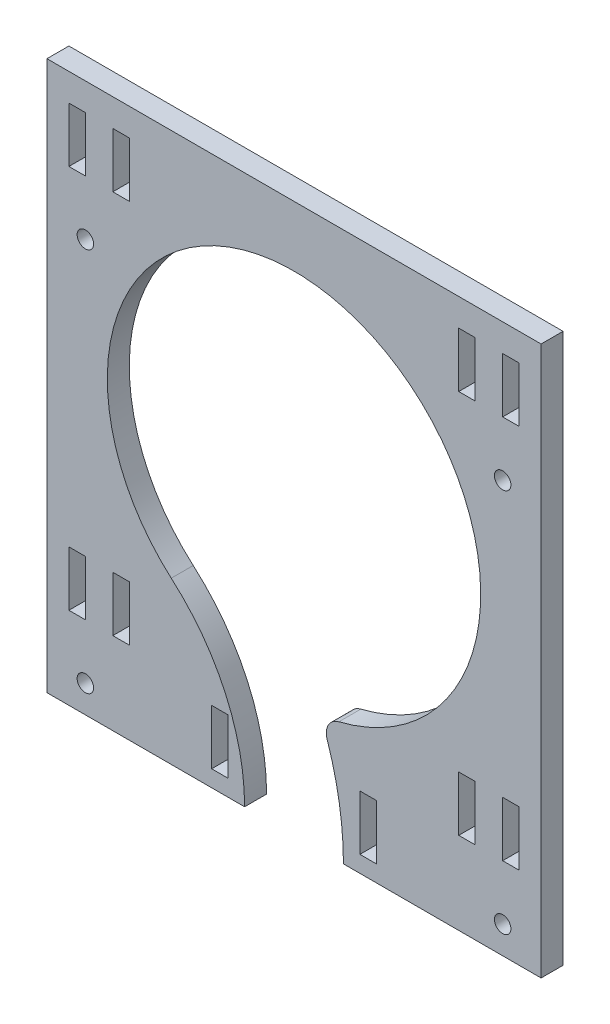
ISO-10303-21;
HEADER;
FILE_DESCRIPTION(('STEP AP214'),'2;1');
FILE_NAME('part.step','',(''),(''),'','','');
FILE_SCHEMA(('AUTOMOTIVE_DESIGN { 1 0 10303 214 1 1 1 1 }'));
ENDSEC;
DATA;
#1=APPLICATION_CONTEXT('core data for automotive mechanical design processes');
#2=APPLICATION_PROTOCOL_DEFINITION('international standard','automotive_design',2000,#1);
#3=PRODUCT_CONTEXT('',#1,'mechanical');
#4=PRODUCT('Part','Part','',(#3));
#5=PRODUCT_RELATED_PRODUCT_CATEGORY('part','',(#4));
#6=PRODUCT_DEFINITION_FORMATION('','',#4);
#7=PRODUCT_DEFINITION_CONTEXT('part definition',#1,'design');
#8=PRODUCT_DEFINITION('design','',#6,#7);
#9=PRODUCT_DEFINITION_SHAPE('','',#8);
#10=(LENGTH_UNIT() NAMED_UNIT(*) SI_UNIT(.MILLI.,.METRE.));
#11=(NAMED_UNIT(*) PLANE_ANGLE_UNIT() SI_UNIT($,.RADIAN.));
#12=(NAMED_UNIT(*) SI_UNIT($,.STERADIAN.) SOLID_ANGLE_UNIT());
#13=UNCERTAINTY_MEASURE_WITH_UNIT(LENGTH_MEASURE(1.E-05),#10,'distance_accuracy_value','');
#14=(GEOMETRIC_REPRESENTATION_CONTEXT(3) GLOBAL_UNCERTAINTY_ASSIGNED_CONTEXT((#13)) GLOBAL_UNIT_ASSIGNED_CONTEXT((#10,
#11,#12)) REPRESENTATION_CONTEXT('',''));
#15=CARTESIAN_POINT('',(0.,0.,0.));
#16=DIRECTION('',(0.,0.,1.));
#17=DIRECTION('',(1.,0.,0.));
#18=AXIS2_PLACEMENT_3D('',#15,#16,#17);
#19=CARTESIAN_POINT('',(-48.0000000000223,-54.9999999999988,4.));
#20=DIRECTION('',(0.,0.,-1.));
#21=DIRECTION('',(-1.,0.,0.));
#22=AXIS2_PLACEMENT_3D('',#19,#20,#21);
#23=CYLINDRICAL_SURFACE('',#22,57.0000000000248);
#24=CARTESIAN_POINT('',(-48.0000000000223,-54.9999999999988,4.));
#25=DIRECTION('',(0.,0.,1.));
#26=DIRECTION('',(1.,0.,0.));
#27=AXIS2_PLACEMENT_3D('',#24,#25,#26);
#28=CIRCLE('',#27,57.0000000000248);
#29=CARTESIAN_POINT('',(9.00000000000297,-55.0000000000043,4.));
#30=VERTEX_POINT('',#29);
#31=CARTESIAN_POINT('',(6.04036169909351,-36.8715883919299,4.));
#32=VERTEX_POINT('',#31);
#33=EDGE_CURVE('E623',#30,#32,#28,.T.);
#34=ORIENTED_EDGE('',*,*,#33,.T.);
#35=DIRECTION('',(0.,0.,-1.));
#36=VECTOR('',#35,1.);
#37=CARTESIAN_POINT('',(6.04036169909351,-36.8715883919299,4.));
#38=LINE('',#37,#36);
#39=CARTESIAN_POINT('',(6.04036169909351,-36.8715883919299,0.));
#40=VERTEX_POINT('',#39);
#41=EDGE_CURVE('E759',#32,#40,#38,.T.);
#42=ORIENTED_EDGE('',*,*,#41,.T.);
#43=CARTESIAN_POINT('',(-48.0000000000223,-54.9999999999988,0.));
#44=DIRECTION('',(0.,0.,1.));
#45=DIRECTION('',(1.,0.,0.));
#46=AXIS2_PLACEMENT_3D('',#43,#44,#45);
#47=CIRCLE('',#46,57.0000000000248);
#48=CARTESIAN_POINT('',(9.00000000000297,-55.0000000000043,0.));
#49=VERTEX_POINT('',#48);
#50=EDGE_CURVE('E616',#49,#40,#47,.T.);
#51=ORIENTED_EDGE('',*,*,#50,.F.);
#52=DIRECTION('',(0.,0.,-1.));
#53=VECTOR('',#52,1.);
#54=CARTESIAN_POINT('',(9.00000000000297,-55.0000000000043,4.));
#55=LINE('',#54,#53);
#56=EDGE_CURVE('E678',#30,#49,#55,.T.);
#57=ORIENTED_EDGE('',*,*,#56,.F.);
#58=EDGE_LOOP('',(#34,#42,#51,#57));
#59=FACE_BOUND('',#58,.T.);
#60=ADVANCED_FACE('F36',(#59),#23,.F.);
#61=CARTESIAN_POINT('',(0.,-55.0000000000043,4.));
#62=DIRECTION('',(0.,1.,0.));
#63=DIRECTION('',(0.,0.,1.));
#64=AXIS2_PLACEMENT_3D('',#61,#62,#63);
#65=PLANE('',#64);
#66=DIRECTION('',(1.,0.,0.));
#67=VECTOR('',#66,1.);
#68=CARTESIAN_POINT('',(0.,-55.0000000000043,0.));
#69=LINE('',#68,#67);
#70=CARTESIAN_POINT('',(45.,-55.0000000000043,0.));
#71=VERTEX_POINT('',#70);
#72=EDGE_CURVE('E647',#49,#71,#69,.T.);
#73=ORIENTED_EDGE('',*,*,#72,.T.);
#74=DIRECTION('',(0.,0.,-1.));
#75=VECTOR('',#74,1.);
#76=CARTESIAN_POINT('',(45.,-55.0000000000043,4.));
#77=LINE('',#76,#75);
#78=CARTESIAN_POINT('',(45.,-55.0000000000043,4.));
#79=VERTEX_POINT('',#78);
#80=EDGE_CURVE('E676',#79,#71,#77,.T.);
#81=ORIENTED_EDGE('',*,*,#80,.F.);
#82=DIRECTION('',(1.,0.,0.));
#83=VECTOR('',#82,1.);
#84=CARTESIAN_POINT('',(0.,-55.0000000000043,4.));
#85=LINE('',#84,#83);
#86=EDGE_CURVE('E626',#30,#79,#85,.T.);
#87=ORIENTED_EDGE('',*,*,#86,.F.);
#88=ORIENTED_EDGE('',*,*,#56,.T.);
#89=EDGE_LOOP('',(#73,#81,#87,#88));
#90=FACE_BOUND('',#89,.T.);
#91=ADVANCED_FACE('F773',(#90),#65,.F.);
#92=CARTESIAN_POINT('',(44.9999999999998,1.87350135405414E-13,4.));
#93=DIRECTION('',(1.,0.,0.));
#94=DIRECTION('',(0.,1.,0.));
#95=AXIS2_PLACEMENT_3D('',#92,#93,#94);
#96=PLANE('',#95);
#97=DIRECTION('',(0.,-1.,0.));
#98=VECTOR('',#97,1.);
#99=CARTESIAN_POINT('',(44.9999999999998,1.87350135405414E-13,0.));
#100=LINE('',#99,#98);
#101=CARTESIAN_POINT('',(45.,45.,0.));
#102=VERTEX_POINT('',#101);
#103=EDGE_CURVE('E650',#102,#71,#100,.T.);
#104=ORIENTED_EDGE('',*,*,#103,.F.);
#105=DIRECTION('',(0.,0.,-1.));
#106=VECTOR('',#105,1.);
#107=CARTESIAN_POINT('',(45.,45.,4.));
#108=LINE('',#107,#106);
#109=CARTESIAN_POINT('',(45.,45.,4.));
#110=VERTEX_POINT('',#109);
#111=EDGE_CURVE('E674',#110,#102,#108,.T.);
#112=ORIENTED_EDGE('',*,*,#111,.F.);
#113=DIRECTION('',(0.,-1.,0.));
#114=VECTOR('',#113,1.);
#115=CARTESIAN_POINT('',(44.9999999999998,1.87350135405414E-13,4.));
#116=LINE('',#115,#114);
#117=EDGE_CURVE('E629',#110,#79,#116,.T.);
#118=ORIENTED_EDGE('',*,*,#117,.T.);
#119=ORIENTED_EDGE('',*,*,#80,.T.);
#120=EDGE_LOOP('',(#104,#112,#118,#119));
#121=FACE_BOUND('',#120,.T.);
#122=ADVANCED_FACE('F789',(#121),#96,.T.);
#123=CARTESIAN_POINT('',(0.,45.,4.));
#124=DIRECTION('',(0.,1.,0.));
#125=DIRECTION('',(0.,0.,1.));
#126=AXIS2_PLACEMENT_3D('',#123,#124,#125);
#127=PLANE('',#126);
#128=DIRECTION('',(1.,0.,0.));
#129=VECTOR('',#128,1.);
#130=CARTESIAN_POINT('',(0.,45.,0.));
#131=LINE('',#130,#129);
#132=CARTESIAN_POINT('',(-45.,45.,0.));
#133=VERTEX_POINT('',#132);
#134=EDGE_CURVE('E653',#133,#102,#131,.T.);
#135=ORIENTED_EDGE('',*,*,#134,.F.);
#136=DIRECTION('',(0.,0.,-1.));
#137=VECTOR('',#136,1.);
#138=CARTESIAN_POINT('',(-45.,45.,4.));
#139=LINE('',#138,#137);
#140=CARTESIAN_POINT('',(-45.,45.,4.));
#141=VERTEX_POINT('',#140);
#142=EDGE_CURVE('E672',#141,#133,#139,.T.);
#143=ORIENTED_EDGE('',*,*,#142,.F.);
#144=DIRECTION('',(1.,0.,0.));
#145=VECTOR('',#144,1.);
#146=CARTESIAN_POINT('',(0.,45.,4.));
#147=LINE('',#146,#145);
#148=EDGE_CURVE('E632',#141,#110,#147,.T.);
#149=ORIENTED_EDGE('',*,*,#148,.T.);
#150=ORIENTED_EDGE('',*,*,#111,.T.);
#151=EDGE_LOOP('',(#135,#143,#149,#150));
#152=FACE_BOUND('',#151,.T.);
#153=ADVANCED_FACE('F794',(#152),#127,.T.);
#154=CARTESIAN_POINT('',(-45.,0.,4.));
#155=DIRECTION('',(-1.,0.,0.));
#156=DIRECTION('',(0.,-1.,0.));
#157=AXIS2_PLACEMENT_3D('',#154,#155,#156);
#158=PLANE('',#157);
#159=DIRECTION('',(0.,1.,0.));
#160=VECTOR('',#159,1.);
#161=CARTESIAN_POINT('',(-45.,0.,0.));
#162=LINE('',#161,#160);
#163=CARTESIAN_POINT('',(-45.,-55.,0.));
#164=VERTEX_POINT('',#163);
#165=EDGE_CURVE('E656',#164,#133,#162,.T.);
#166=ORIENTED_EDGE('',*,*,#165,.F.);
#167=DIRECTION('',(0.,0.,-1.));
#168=VECTOR('',#167,1.);
#169=CARTESIAN_POINT('',(-45.,-55.,4.));
#170=LINE('',#169,#168);
#171=CARTESIAN_POINT('',(-45.,-55.,4.));
#172=VERTEX_POINT('',#171);
#173=EDGE_CURVE('E670',#172,#164,#170,.T.);
#174=ORIENTED_EDGE('',*,*,#173,.F.);
#175=DIRECTION('',(0.,1.,0.));
#176=VECTOR('',#175,1.);
#177=CARTESIAN_POINT('',(-45.,0.,4.));
#178=LINE('',#177,#176);
#179=EDGE_CURVE('E635',#172,#141,#178,.T.);
#180=ORIENTED_EDGE('',*,*,#179,.T.);
#181=ORIENTED_EDGE('',*,*,#142,.T.);
#182=EDGE_LOOP('',(#166,#174,#180,#181));
#183=FACE_BOUND('',#182,.T.);
#184=ADVANCED_FACE('F798',(#183),#158,.T.);
#185=CARTESIAN_POINT('',(0.,-55.,4.));
#186=DIRECTION('',(0.,1.,0.));
#187=DIRECTION('',(0.,0.,1.));
#188=AXIS2_PLACEMENT_3D('',#185,#186,#187);
#189=PLANE('',#188);
#190=DIRECTION('',(1.,0.,0.));
#191=VECTOR('',#190,1.);
#192=CARTESIAN_POINT('',(0.,-55.,0.));
#193=LINE('',#192,#191);
#194=CARTESIAN_POINT('',(-9.00000000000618,-55.,0.));
#195=VERTEX_POINT('',#194);
#196=EDGE_CURVE('E659',#164,#195,#193,.T.);
#197=ORIENTED_EDGE('',*,*,#196,.T.);
#198=DIRECTION('',(0.,0.,-1.));
#199=VECTOR('',#198,1.);
#200=CARTESIAN_POINT('',(-9.00000000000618,-55.,4.));
#201=LINE('',#200,#199);
#202=CARTESIAN_POINT('',(-9.00000000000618,-55.,4.));
#203=VERTEX_POINT('',#202);
#204=EDGE_CURVE('E667',#203,#195,#201,.T.);
#205=ORIENTED_EDGE('',*,*,#204,.F.);
#206=DIRECTION('',(1.,0.,0.));
#207=VECTOR('',#206,1.);
#208=CARTESIAN_POINT('',(0.,-55.,4.));
#209=LINE('',#208,#207);
#210=EDGE_CURVE('E638',#172,#203,#209,.T.);
#211=ORIENTED_EDGE('',*,*,#210,.F.);
#212=ORIENTED_EDGE('',*,*,#173,.T.);
#213=EDGE_LOOP('',(#197,#205,#211,#212));
#214=FACE_BOUND('',#213,.T.);
#215=ADVANCED_FACE('F802',(#214),#189,.F.);
#216=CARTESIAN_POINT('',(-48.0000000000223,-54.9999999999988,4.));
#217=DIRECTION('',(0.,0.,-1.));
#218=DIRECTION('',(-1.,0.,0.));
#219=AXIS2_PLACEMENT_3D('',#216,#217,#218);
#220=CYLINDRICAL_SURFACE('',#219,39.0000000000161);
#221=CARTESIAN_POINT('',(-48.0000000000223,-54.9999999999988,0.));
#222=DIRECTION('',(0.,0.,1.));
#223=DIRECTION('',(1.,0.,0.));
#224=AXIS2_PLACEMENT_3D('',#221,#222,#223);
#225=CIRCLE('',#224,39.0000000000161);
#226=CARTESIAN_POINT('',(-22.3561643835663,-25.6164383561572,0.));
#227=VERTEX_POINT('',#226);
#228=EDGE_CURVE('E661',#195,#227,#225,.T.);
#229=ORIENTED_EDGE('',*,*,#228,.T.);
#230=DIRECTION('',(0.,0.,-1.));
#231=VECTOR('',#230,1.);
#232=CARTESIAN_POINT('',(-22.3561643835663,-25.6164383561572,4.));
#233=LINE('',#232,#231);
#234=CARTESIAN_POINT('',(-22.3561643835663,-25.6164383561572,4.));
#235=VERTEX_POINT('',#234);
#236=EDGE_CURVE('E645',#235,#227,#233,.T.);
#237=ORIENTED_EDGE('',*,*,#236,.F.);
#238=CARTESIAN_POINT('',(-48.0000000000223,-54.9999999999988,4.));
#239=DIRECTION('',(0.,0.,1.));
#240=DIRECTION('',(1.,0.,0.));
#241=AXIS2_PLACEMENT_3D('',#238,#239,#240);
#242=CIRCLE('',#241,39.0000000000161);
#243=EDGE_CURVE('E640',#203,#235,#242,.T.);
#244=ORIENTED_EDGE('',*,*,#243,.F.);
#245=ORIENTED_EDGE('',*,*,#204,.T.);
#246=EDGE_LOOP('',(#229,#237,#244,#245));
#247=FACE_BOUND('',#246,.T.);
#248=ADVANCED_FACE('F806',(#247),#220,.T.);
#249=CARTESIAN_POINT('',(0.,0.,4.));
#250=DIRECTION('',(0.,0.,-1.));
#251=DIRECTION('',(-1.,0.,0.));
#252=AXIS2_PLACEMENT_3D('',#249,#250,#251);
#253=CYLINDRICAL_SURFACE('',#252,33.9999999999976);
#254=CARTESIAN_POINT('',(0.,0.,0.));
#255=DIRECTION('',(0.,0.,1.));
#256=DIRECTION('',(1.,0.,0.));
#257=AXIS2_PLACEMENT_3D('',#254,#255,#256);
#258=CIRCLE('',#257,33.9999999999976);
#259=CARTESIAN_POINT('',(8.16421899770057,-33.005234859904,0.));
#260=VERTEX_POINT('',#259);
#261=EDGE_CURVE('E627',#260,#227,#258,.T.);
#262=ORIENTED_EDGE('',*,*,#261,.F.);
#263=DIRECTION('',(0.,0.,-1.));
#264=VECTOR('',#263,1.);
#265=CARTESIAN_POINT('',(8.16421899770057,-33.005234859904,4.));
#266=LINE('',#265,#264);
#267=CARTESIAN_POINT('',(8.16421899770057,-33.005234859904,4.));
#268=VERTEX_POINT('',#267);
#269=EDGE_CURVE('E44',#260,#268,#266,.F.);
#270=ORIENTED_EDGE('',*,*,#269,.T.);
#271=CARTESIAN_POINT('',(0.,0.,4.));
#272=DIRECTION('',(0.,0.,1.));
#273=DIRECTION('',(1.,0.,0.));
#274=AXIS2_PLACEMENT_3D('',#271,#272,#273);
#275=CIRCLE('',#274,33.9999999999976);
#276=EDGE_CURVE('E643',#268,#235,#275,.T.);
#277=ORIENTED_EDGE('',*,*,#276,.T.);
#278=ORIENTED_EDGE('',*,*,#236,.T.);
#279=EDGE_LOOP('',(#262,#270,#277,#278));
#280=FACE_BOUND('',#279,.T.);
#281=ADVANCED_FACE('F810',(#280),#253,.F.);
#282=CARTESIAN_POINT('',(0.,0.,4.));
#283=DIRECTION('',(0.,0.,1.));
#284=DIRECTION('',(1.,0.,0.));
#285=AXIS2_PLACEMENT_3D('',#282,#283,#284);
#286=PLANE('',#285);
#287=DIRECTION('',(-1.,0.,0.));
#288=VECTOR('',#287,1.);
#289=CARTESIAN_POINT('',(-15.,-42.,4.));
#290=LINE('',#289,#288);
#291=CARTESIAN_POINT('',(-12.,-42.,4.));
#292=VERTEX_POINT('',#291);
#293=CARTESIAN_POINT('',(-15.,-42.,4.));
#294=VERTEX_POINT('',#293);
#295=EDGE_CURVE('E386',#292,#294,#290,.T.);
#296=ORIENTED_EDGE('',*,*,#295,.F.);
#297=DIRECTION('',(0.,1.,0.));
#298=VECTOR('',#297,1.);
#299=CARTESIAN_POINT('',(-12.,-52.,4.));
#300=LINE('',#299,#298);
#301=CARTESIAN_POINT('',(-12.,-52.,4.));
#302=VERTEX_POINT('',#301);
#303=EDGE_CURVE('E395',#302,#292,#300,.T.);
#304=ORIENTED_EDGE('',*,*,#303,.F.);
#305=DIRECTION('',(1.,0.,0.));
#306=VECTOR('',#305,1.);
#307=CARTESIAN_POINT('',(-15.,-52.,4.));
#308=LINE('',#307,#306);
#309=CARTESIAN_POINT('',(-15.,-52.,4.));
#310=VERTEX_POINT('',#309);
#311=EDGE_CURVE('E392',#310,#302,#308,.T.);
#312=ORIENTED_EDGE('',*,*,#311,.F.);
#313=DIRECTION('',(0.,-1.,0.));
#314=VECTOR('',#313,1.);
#315=CARTESIAN_POINT('',(-15.,-42.,4.));
#316=LINE('',#315,#314);
#317=EDGE_CURVE('E388',#294,#310,#316,.T.);
#318=ORIENTED_EDGE('',*,*,#317,.F.);
#319=EDGE_LOOP('',(#296,#304,#312,#318));
#320=FACE_BOUND('',#319,.T.);
#321=CARTESIAN_POINT('',(-38.,20.,4.));
#322=DIRECTION('',(0.,0.,1.));
#323=DIRECTION('',(1.,0.,0.));
#324=AXIS2_PLACEMENT_3D('',#321,#322,#323);
#325=CIRCLE('',#324,1.5);
#326=CARTESIAN_POINT('',(-36.5,20.,4.));
#327=VERTEX_POINT('',#326);
#328=EDGE_CURVE('E381',#327,#327,#325,.T.);
#329=ORIENTED_EDGE('',*,*,#328,.F.);
#330=EDGE_LOOP('',(#329));
#331=FACE_BOUND('',#330,.T.);
#332=CARTESIAN_POINT('',(-38.,-50.,4.));
#333=DIRECTION('',(0.,0.,1.));
#334=DIRECTION('',(1.,0.,0.));
#335=AXIS2_PLACEMENT_3D('',#332,#333,#334);
#336=CIRCLE('',#335,1.5);
#337=CARTESIAN_POINT('',(-36.5,-50.,4.));
#338=VERTEX_POINT('',#337);
#339=EDGE_CURVE('E384',#338,#338,#336,.T.);
#340=ORIENTED_EDGE('',*,*,#339,.F.);
#341=EDGE_LOOP('',(#340));
#342=FACE_BOUND('',#341,.T.);
#343=DIRECTION('',(0.,1.,0.));
#344=VECTOR('',#343,1.);
#345=CARTESIAN_POINT('',(-38.,30.,4.));
#346=LINE('',#345,#344);
#347=CARTESIAN_POINT('',(-38.,30.,4.));
#348=VERTEX_POINT('',#347);
#349=CARTESIAN_POINT('',(-38.,40.,4.));
#350=VERTEX_POINT('',#349);
#351=EDGE_CURVE('E406',#348,#350,#346,.T.);
#352=ORIENTED_EDGE('',*,*,#351,.F.);
#353=DIRECTION('',(1.,0.,0.));
#354=VECTOR('',#353,1.);
#355=CARTESIAN_POINT('',(-41.,30.,4.));
#356=LINE('',#355,#354);
#357=CARTESIAN_POINT('',(-41.,30.,4.));
#358=VERTEX_POINT('',#357);
#359=EDGE_CURVE('E414',#358,#348,#356,.T.);
#360=ORIENTED_EDGE('',*,*,#359,.F.);
#361=DIRECTION('',(0.,-1.,0.));
#362=VECTOR('',#361,1.);
#363=CARTESIAN_POINT('',(-41.,40.,4.));
#364=LINE('',#363,#362);
#365=CARTESIAN_POINT('',(-41.,40.,4.));
#366=VERTEX_POINT('',#365);
#367=EDGE_CURVE('E411',#366,#358,#364,.T.);
#368=ORIENTED_EDGE('',*,*,#367,.F.);
#369=DIRECTION('',(-1.,0.,0.));
#370=VECTOR('',#369,1.);
#371=CARTESIAN_POINT('',(-38.,40.,4.));
#372=LINE('',#371,#370);
#373=EDGE_CURVE('E408',#350,#366,#372,.T.);
#374=ORIENTED_EDGE('',*,*,#373,.F.);
#375=EDGE_LOOP('',(#352,#360,#368,#374));
#376=FACE_BOUND('',#375,.T.);
#377=DIRECTION('',(0.,-1.,0.));
#378=VECTOR('',#377,1.);
#379=CARTESIAN_POINT('',(38.,30.,4.));
#380=LINE('',#379,#378);
#381=CARTESIAN_POINT('',(38.,40.,4.));
#382=VERTEX_POINT('',#381);
#383=CARTESIAN_POINT('',(38.,30.,4.));
#384=VERTEX_POINT('',#383);
#385=EDGE_CURVE('E378',#382,#384,#380,.T.);
#386=ORIENTED_EDGE('',*,*,#385,.F.);
#387=DIRECTION('',(-1.,0.,0.));
#388=VECTOR('',#387,1.);
#389=CARTESIAN_POINT('',(38.,40.,4.));
#390=LINE('',#389,#388);
#391=CARTESIAN_POINT('',(41.,40.,4.));
#392=VERTEX_POINT('',#391);
#393=EDGE_CURVE('E458',#392,#382,#390,.T.);
#394=ORIENTED_EDGE('',*,*,#393,.F.);
#395=DIRECTION('',(0.,1.,0.));
#396=VECTOR('',#395,1.);
#397=CARTESIAN_POINT('',(41.,40.,4.));
#398=LINE('',#397,#396);
#399=CARTESIAN_POINT('',(41.,30.,4.));
#400=VERTEX_POINT('',#399);
#401=EDGE_CURVE('E455',#400,#392,#398,.T.);
#402=ORIENTED_EDGE('',*,*,#401,.F.);
#403=DIRECTION('',(1.,0.,0.));
#404=VECTOR('',#403,1.);
#405=CARTESIAN_POINT('',(41.,30.,4.));
#406=LINE('',#405,#404);
#407=EDGE_CURVE('E452',#384,#400,#406,.T.);
#408=ORIENTED_EDGE('',*,*,#407,.F.);
#409=EDGE_LOOP('',(#386,#394,#402,#408));
#410=FACE_BOUND('',#409,.T.);
#411=DIRECTION('',(0.,1.,0.));
#412=VECTOR('',#411,1.);
#413=CARTESIAN_POINT('',(15.,-42.,4.));
#414=LINE('',#413,#412);
#415=CARTESIAN_POINT('',(15.,-52.,4.));
#416=VERTEX_POINT('',#415);
#417=CARTESIAN_POINT('',(15.,-42.,4.));
#418=VERTEX_POINT('',#417);
#419=EDGE_CURVE('E429',#416,#418,#414,.T.);
#420=ORIENTED_EDGE('',*,*,#419,.F.);
#421=DIRECTION('',(1.,0.,0.));
#422=VECTOR('',#421,1.);
#423=CARTESIAN_POINT('',(15.,-52.,4.));
#424=LINE('',#423,#422);
#425=CARTESIAN_POINT('',(12.,-52.,4.));
#426=VERTEX_POINT('',#425);
#427=EDGE_CURVE('E438',#426,#416,#424,.T.);
#428=ORIENTED_EDGE('',*,*,#427,.F.);
#429=DIRECTION('',(0.,-1.,0.));
#430=VECTOR('',#429,1.);
#431=CARTESIAN_POINT('',(12.,-52.,4.));
#432=LINE('',#431,#430);
#433=CARTESIAN_POINT('',(12.,-42.,4.));
#434=VERTEX_POINT('',#433);
#435=EDGE_CURVE('E435',#434,#426,#432,.T.);
#436=ORIENTED_EDGE('',*,*,#435,.F.);
#437=DIRECTION('',(-1.,0.,0.));
#438=VECTOR('',#437,1.);
#439=CARTESIAN_POINT('',(15.,-42.,4.));
#440=LINE('',#439,#438);
#441=EDGE_CURVE('E431',#418,#434,#440,.T.);
#442=ORIENTED_EDGE('',*,*,#441,.F.);
#443=EDGE_LOOP('',(#420,#428,#436,#442));
#444=FACE_BOUND('',#443,.T.);
#445=CARTESIAN_POINT('',(38.,-50.,4.));
#446=DIRECTION('',(0.,0.,1.));
#447=DIRECTION('',(-1.,0.,0.));
#448=AXIS2_PLACEMENT_3D('',#445,#446,#447);
#449=CIRCLE('',#448,1.5);
#450=CARTESIAN_POINT('',(36.5,-50.,4.));
#451=VERTEX_POINT('',#450);
#452=EDGE_CURVE('E444',#451,#451,#449,.T.);
#453=ORIENTED_EDGE('',*,*,#452,.F.);
#454=EDGE_LOOP('',(#453));
#455=FACE_BOUND('',#454,.T.);
#456=CARTESIAN_POINT('',(38.,20.,4.));
#457=DIRECTION('',(0.,0.,1.));
#458=DIRECTION('',(-1.,0.,0.));
#459=AXIS2_PLACEMENT_3D('',#456,#457,#458);
#460=CIRCLE('',#459,1.5);
#461=CARTESIAN_POINT('',(36.5,20.,4.));
#462=VERTEX_POINT('',#461);
#463=EDGE_CURVE('E389',#462,#462,#460,.T.);
#464=ORIENTED_EDGE('',*,*,#463,.F.);
#465=EDGE_LOOP('',(#464));
#466=FACE_BOUND('',#465,.T.);
#467=DIRECTION('',(0.,1.,0.));
#468=VECTOR('',#467,1.);
#469=CARTESIAN_POINT('',(41.,-40.,4.));
#470=LINE('',#469,#468);
#471=CARTESIAN_POINT('',(41.,-40.,4.));
#472=VERTEX_POINT('',#471);
#473=CARTESIAN_POINT('',(41.,-30.,4.));
#474=VERTEX_POINT('',#473);
#475=EDGE_CURVE('E366',#472,#474,#470,.T.);
#476=ORIENTED_EDGE('',*,*,#475,.F.);
#477=DIRECTION('',(1.,0.,0.));
#478=VECTOR('',#477,1.);
#479=CARTESIAN_POINT('',(38.,-40.,4.));
#480=LINE('',#479,#478);
#481=CARTESIAN_POINT('',(38.,-40.,4.));
#482=VERTEX_POINT('',#481);
#483=EDGE_CURVE('E371',#482,#472,#480,.T.);
#484=ORIENTED_EDGE('',*,*,#483,.F.);
#485=DIRECTION('',(0.,-1.,0.));
#486=VECTOR('',#485,1.);
#487=CARTESIAN_POINT('',(38.,-30.,4.));
#488=LINE('',#487,#486);
#489=CARTESIAN_POINT('',(38.,-30.,4.));
#490=VERTEX_POINT('',#489);
#491=EDGE_CURVE('E350',#490,#482,#488,.T.);
#492=ORIENTED_EDGE('',*,*,#491,.F.);
#493=DIRECTION('',(-1.,0.,0.));
#494=VECTOR('',#493,1.);
#495=CARTESIAN_POINT('',(41.,-30.,4.));
#496=LINE('',#495,#494);
#497=EDGE_CURVE('E361',#474,#490,#496,.T.);
#498=ORIENTED_EDGE('',*,*,#497,.F.);
#499=EDGE_LOOP('',(#476,#484,#492,#498));
#500=FACE_BOUND('',#499,.T.);
#501=DIRECTION('',(-1.,0.,0.));
#502=VECTOR('',#501,1.);
#503=CARTESIAN_POINT('',(-41.,-30.,4.));
#504=LINE('',#503,#502);
#505=CARTESIAN_POINT('',(-38.,-30.,4.));
#506=VERTEX_POINT('',#505);
#507=CARTESIAN_POINT('',(-41.,-30.,4.));
#508=VERTEX_POINT('',#507);
#509=EDGE_CURVE('E420',#506,#508,#504,.T.);
#510=ORIENTED_EDGE('',*,*,#509,.F.);
#511=DIRECTION('',(0.,1.,0.));
#512=VECTOR('',#511,1.);
#513=CARTESIAN_POINT('',(-38.,-30.,4.));
#514=LINE('',#513,#512);
#515=CARTESIAN_POINT('',(-38.,-40.,4.));
#516=VERTEX_POINT('',#515);
#517=EDGE_CURVE('E480',#516,#506,#514,.T.);
#518=ORIENTED_EDGE('',*,*,#517,.F.);
#519=DIRECTION('',(1.,0.,0.));
#520=VECTOR('',#519,1.);
#521=CARTESIAN_POINT('',(-38.,-40.,4.));
#522=LINE('',#521,#520);
#523=CARTESIAN_POINT('',(-41.,-40.,4.));
#524=VERTEX_POINT('',#523);
#525=EDGE_CURVE('E477',#524,#516,#522,.T.);
#526=ORIENTED_EDGE('',*,*,#525,.F.);
#527=DIRECTION('',(0.,-1.,0.));
#528=VECTOR('',#527,1.);
#529=CARTESIAN_POINT('',(-41.,-40.,4.));
#530=LINE('',#529,#528);
#531=EDGE_CURVE('E474',#508,#524,#530,.T.);
#532=ORIENTED_EDGE('',*,*,#531,.F.);
#533=EDGE_LOOP('',(#510,#518,#526,#532));
#534=FACE_BOUND('',#533,.T.);
#535=DIRECTION('',(-1.,0.,0.));
#536=VECTOR('',#535,1.);
#537=CARTESIAN_POINT('',(33.,40.,4.));
#538=LINE('',#537,#536);
#539=CARTESIAN_POINT('',(33.,40.,4.));
#540=VERTEX_POINT('',#539);
#541=CARTESIAN_POINT('',(30.,40.,4.));
#542=VERTEX_POINT('',#541);
#543=EDGE_CURVE('E541',#540,#542,#538,.T.);
#544=ORIENTED_EDGE('',*,*,#543,.F.);
#545=DIRECTION('',(0.,1.,0.));
#546=VECTOR('',#545,1.);
#547=CARTESIAN_POINT('',(33.,30.,4.));
#548=LINE('',#547,#546);
#549=CARTESIAN_POINT('',(33.,30.,4.));
#550=VERTEX_POINT('',#549);
#551=EDGE_CURVE('E531',#550,#540,#548,.T.);
#552=ORIENTED_EDGE('',*,*,#551,.F.);
#553=DIRECTION('',(1.,0.,0.));
#554=VECTOR('',#553,1.);
#555=CARTESIAN_POINT('',(30.,30.,4.));
#556=LINE('',#555,#554);
#557=CARTESIAN_POINT('',(30.,30.,4.));
#558=VERTEX_POINT('',#557);
#559=EDGE_CURVE('E547',#558,#550,#556,.T.);
#560=ORIENTED_EDGE('',*,*,#559,.F.);
#561=DIRECTION('',(0.,-1.,0.));
#562=VECTOR('',#561,1.);
#563=CARTESIAN_POINT('',(30.,40.,4.));
#564=LINE('',#563,#562);
#565=EDGE_CURVE('E543',#542,#558,#564,.T.);
#566=ORIENTED_EDGE('',*,*,#565,.F.);
#567=EDGE_LOOP('',(#544,#552,#560,#566));
#568=FACE_BOUND('',#567,.T.);
#569=DIRECTION('',(-1.,0.,0.));
#570=VECTOR('',#569,1.);
#571=CARTESIAN_POINT('',(-30.,-30.,4.));
#572=LINE('',#571,#570);
#573=CARTESIAN_POINT('',(-30.,-30.,4.));
#574=VERTEX_POINT('',#573);
#575=CARTESIAN_POINT('',(-33.,-30.,4.));
#576=VERTEX_POINT('',#575);
#577=EDGE_CURVE('E520',#574,#576,#572,.T.);
#578=ORIENTED_EDGE('',*,*,#577,.F.);
#579=DIRECTION('',(0.,1.,0.));
#580=VECTOR('',#579,1.);
#581=CARTESIAN_POINT('',(-30.,-40.,4.));
#582=LINE('',#581,#580);
#583=CARTESIAN_POINT('',(-30.,-40.,4.));
#584=VERTEX_POINT('',#583);
#585=EDGE_CURVE('E565',#584,#574,#582,.T.);
#586=ORIENTED_EDGE('',*,*,#585,.F.);
#587=DIRECTION('',(1.,0.,0.));
#588=VECTOR('',#587,1.);
#589=CARTESIAN_POINT('',(-33.,-40.,4.));
#590=LINE('',#589,#588);
#591=CARTESIAN_POINT('',(-33.,-40.,4.));
#592=VERTEX_POINT('',#591);
#593=EDGE_CURVE('E579',#592,#584,#590,.T.);
#594=ORIENTED_EDGE('',*,*,#593,.F.);
#595=DIRECTION('',(0.,-1.,0.));
#596=VECTOR('',#595,1.);
#597=CARTESIAN_POINT('',(-33.,-30.,4.));
#598=LINE('',#597,#596);
#599=EDGE_CURVE('E576',#576,#592,#598,.T.);
#600=ORIENTED_EDGE('',*,*,#599,.F.);
#601=EDGE_LOOP('',(#578,#586,#594,#600));
#602=FACE_BOUND('',#601,.T.);
#603=DIRECTION('',(-1.,0.,0.));
#604=VECTOR('',#603,1.);
#605=CARTESIAN_POINT('',(33.,-30.,4.));
#606=LINE('',#605,#604);
#607=CARTESIAN_POINT('',(33.,-30.,4.));
#608=VERTEX_POINT('',#607);
#609=CARTESIAN_POINT('',(30.,-30.,4.));
#610=VERTEX_POINT('',#609);
#611=EDGE_CURVE('E507',#608,#610,#606,.T.);
#612=ORIENTED_EDGE('',*,*,#611,.F.);
#613=DIRECTION('',(0.,1.,0.));
#614=VECTOR('',#613,1.);
#615=CARTESIAN_POINT('',(33.,-40.,4.));
#616=LINE('',#615,#614);
#617=CARTESIAN_POINT('',(33.,-40.,4.));
#618=VERTEX_POINT('',#617);
#619=EDGE_CURVE('E497',#618,#608,#616,.T.);
#620=ORIENTED_EDGE('',*,*,#619,.F.);
#621=DIRECTION('',(1.,0.,0.));
#622=VECTOR('',#621,1.);
#623=CARTESIAN_POINT('',(30.,-40.,4.));
#624=LINE('',#623,#622);
#625=CARTESIAN_POINT('',(30.,-40.,4.));
#626=VERTEX_POINT('',#625);
#627=EDGE_CURVE('E513',#626,#618,#624,.T.);
#628=ORIENTED_EDGE('',*,*,#627,.F.);
#629=DIRECTION('',(0.,-1.,0.));
#630=VECTOR('',#629,1.);
#631=CARTESIAN_POINT('',(30.,-30.,4.));
#632=LINE('',#631,#630);
#633=EDGE_CURVE('E509',#610,#626,#632,.T.);
#634=ORIENTED_EDGE('',*,*,#633,.F.);
#635=EDGE_LOOP('',(#612,#620,#628,#634));
#636=FACE_BOUND('',#635,.T.);
#637=DIRECTION('',(-1.,0.,0.));
#638=VECTOR('',#637,1.);
#639=CARTESIAN_POINT('',(-30.,40.,4.));
#640=LINE('',#639,#638);
#641=CARTESIAN_POINT('',(-30.,40.,4.));
#642=VERTEX_POINT('',#641);
#643=CARTESIAN_POINT('',(-33.,40.,4.));
#644=VERTEX_POINT('',#643);
#645=EDGE_CURVE('E554',#642,#644,#640,.T.);
#646=ORIENTED_EDGE('',*,*,#645,.F.);
#647=DIRECTION('',(0.,1.,0.));
#648=VECTOR('',#647,1.);
#649=CARTESIAN_POINT('',(-30.,30.,4.));
#650=LINE('',#649,#648);
#651=CARTESIAN_POINT('',(-30.,30.,4.));
#652=VERTEX_POINT('',#651);
#653=EDGE_CURVE('E595',#652,#642,#650,.T.);
#654=ORIENTED_EDGE('',*,*,#653,.F.);
#655=DIRECTION('',(1.,0.,0.));
#656=VECTOR('',#655,1.);
#657=CARTESIAN_POINT('',(-33.,30.,4.));
#658=LINE('',#657,#656);
#659=CARTESIAN_POINT('',(-33.,30.,4.));
#660=VERTEX_POINT('',#659);
#661=EDGE_CURVE('E609',#660,#652,#658,.T.);
#662=ORIENTED_EDGE('',*,*,#661,.F.);
#663=DIRECTION('',(0.,-1.,0.));
#664=VECTOR('',#663,1.);
#665=CARTESIAN_POINT('',(-33.,40.,4.));
#666=LINE('',#665,#664);
#667=EDGE_CURVE('E606',#644,#660,#666,.T.);
#668=ORIENTED_EDGE('',*,*,#667,.F.);
#669=EDGE_LOOP('',(#646,#654,#662,#668));
#670=FACE_BOUND('',#669,.T.);
#671=ORIENTED_EDGE('',*,*,#276,.F.);
#672=CARTESIAN_POINT('',(8.88459126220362,-35.9174614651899,4.));
#673=DIRECTION('',(0.,0.,1.));
#674=DIRECTION('',(1.,0.,0.));
#675=AXIS2_PLACEMENT_3D('',#672,#673,#674);
#676=CIRCLE('',#675,3.);
#677=EDGE_CURVE('E11',#268,#32,#676,.T.);
#678=ORIENTED_EDGE('',*,*,#677,.T.);
#679=ORIENTED_EDGE('',*,*,#33,.F.);
#680=ORIENTED_EDGE('',*,*,#86,.T.);
#681=ORIENTED_EDGE('',*,*,#117,.F.);
#682=ORIENTED_EDGE('',*,*,#148,.F.);
#683=ORIENTED_EDGE('',*,*,#179,.F.);
#684=ORIENTED_EDGE('',*,*,#210,.T.);
#685=ORIENTED_EDGE('',*,*,#243,.T.);
#686=EDGE_LOOP('',(#671,#678,#679,#680,#681,#682,#683,#684,#685));
#687=FACE_BOUND('',#686,.T.);
#688=ADVANCED_FACE('F368',(#320,#331,#342,#376,#410,#444,#455,#466,#500,#534,#568,#602,#636,
#670,#687),#286,.T.);
#689=CARTESIAN_POINT('',(0.,0.,0.));
#690=DIRECTION('',(0.,0.,1.));
#691=DIRECTION('',(1.,0.,0.));
#692=AXIS2_PLACEMENT_3D('',#689,#690,#691);
#693=PLANE('',#692);
#694=DIRECTION('',(0.,1.,0.));
#695=VECTOR('',#694,1.);
#696=CARTESIAN_POINT('',(-12.,0.,0.));
#697=LINE('',#696,#695);
#698=CARTESIAN_POINT('',(-12.,-52.,0.));
#699=VERTEX_POINT('',#698);
#700=CARTESIAN_POINT('',(-12.,-42.,0.));
#701=VERTEX_POINT('',#700);
#702=EDGE_CURVE('E753',#699,#701,#697,.T.);
#703=ORIENTED_EDGE('',*,*,#702,.T.);
#704=DIRECTION('',(-1.,0.,0.));
#705=VECTOR('',#704,1.);
#706=CARTESIAN_POINT('',(0.,-42.,0.));
#707=LINE('',#706,#705);
#708=CARTESIAN_POINT('',(-15.,-42.,0.));
#709=VERTEX_POINT('',#708);
#710=EDGE_CURVE('E756',#701,#709,#707,.T.);
#711=ORIENTED_EDGE('',*,*,#710,.T.);
#712=DIRECTION('',(0.,-1.,0.));
#713=VECTOR('',#712,1.);
#714=CARTESIAN_POINT('',(-15.,0.,0.));
#715=LINE('',#714,#713);
#716=CARTESIAN_POINT('',(-15.,-52.,0.));
#717=VERTEX_POINT('',#716);
#718=EDGE_CURVE('E743',#709,#717,#715,.T.);
#719=ORIENTED_EDGE('',*,*,#718,.T.);
#720=DIRECTION('',(1.,0.,0.));
#721=VECTOR('',#720,1.);
#722=CARTESIAN_POINT('',(0.,-52.,0.));
#723=LINE('',#722,#721);
#724=EDGE_CURVE('E750',#717,#699,#723,.T.);
#725=ORIENTED_EDGE('',*,*,#724,.T.);
#726=EDGE_LOOP('',(#703,#711,#719,#725));
#727=FACE_BOUND('',#726,.T.);
#728=CARTESIAN_POINT('',(-38.,20.,0.));
#729=DIRECTION('',(0.,0.,1.));
#730=DIRECTION('',(1.,0.,0.));
#731=AXIS2_PLACEMENT_3D('',#728,#729,#730);
#732=CIRCLE('',#731,1.5);
#733=CARTESIAN_POINT('',(-36.5,20.,0.));
#734=VERTEX_POINT('',#733);
#735=EDGE_CURVE('E510',#734,#734,#732,.T.);
#736=ORIENTED_EDGE('',*,*,#735,.T.);
#737=EDGE_LOOP('',(#736));
#738=FACE_BOUND('',#737,.T.);
#739=CARTESIAN_POINT('',(-38.,-50.,0.));
#740=DIRECTION('',(0.,0.,1.));
#741=DIRECTION('',(1.,0.,0.));
#742=AXIS2_PLACEMENT_3D('',#739,#740,#741);
#743=CIRCLE('',#742,1.5);
#744=CARTESIAN_POINT('',(-36.5,-50.,0.));
#745=VERTEX_POINT('',#744);
#746=EDGE_CURVE('E707',#745,#745,#743,.T.);
#747=ORIENTED_EDGE('',*,*,#746,.T.);
#748=EDGE_LOOP('',(#747));
#749=FACE_BOUND('',#748,.T.);
#750=DIRECTION('',(1.,0.,0.));
#751=VECTOR('',#750,1.);
#752=CARTESIAN_POINT('',(0.,30.,0.));
#753=LINE('',#752,#751);
#754=CARTESIAN_POINT('',(-41.,30.,0.));
#755=VERTEX_POINT('',#754);
#756=CARTESIAN_POINT('',(-38.,30.,0.));
#757=VERTEX_POINT('',#756);
#758=EDGE_CURVE('E737',#755,#757,#753,.T.);
#759=ORIENTED_EDGE('',*,*,#758,.T.);
#760=DIRECTION('',(0.,1.,0.));
#761=VECTOR('',#760,1.);
#762=CARTESIAN_POINT('',(-38.,0.,0.));
#763=LINE('',#762,#761);
#764=CARTESIAN_POINT('',(-38.,40.,0.));
#765=VERTEX_POINT('',#764);
#766=EDGE_CURVE('E740',#757,#765,#763,.T.);
#767=ORIENTED_EDGE('',*,*,#766,.T.);
#768=DIRECTION('',(-1.,0.,0.));
#769=VECTOR('',#768,1.);
#770=CARTESIAN_POINT('',(0.,40.,0.));
#771=LINE('',#770,#769);
#772=CARTESIAN_POINT('',(-41.,40.,0.));
#773=VERTEX_POINT('',#772);
#774=EDGE_CURVE('E731',#765,#773,#771,.T.);
#775=ORIENTED_EDGE('',*,*,#774,.T.);
#776=DIRECTION('',(0.,-1.,0.));
#777=VECTOR('',#776,1.);
#778=CARTESIAN_POINT('',(-41.,0.,0.));
#779=LINE('',#778,#777);
#780=EDGE_CURVE('E734',#773,#755,#779,.T.);
#781=ORIENTED_EDGE('',*,*,#780,.T.);
#782=EDGE_LOOP('',(#759,#767,#775,#781));
#783=FACE_BOUND('',#782,.T.);
#784=DIRECTION('',(-1.,0.,0.));
#785=VECTOR('',#784,1.);
#786=CARTESIAN_POINT('',(0.,40.,0.));
#787=LINE('',#786,#785);
#788=CARTESIAN_POINT('',(41.,40.,0.));
#789=VERTEX_POINT('',#788);
#790=CARTESIAN_POINT('',(38.,40.,0.));
#791=VERTEX_POINT('',#790);
#792=EDGE_CURVE('E725',#789,#791,#787,.T.);
#793=ORIENTED_EDGE('',*,*,#792,.T.);
#794=DIRECTION('',(0.,-1.,0.));
#795=VECTOR('',#794,1.);
#796=CARTESIAN_POINT('',(38.,0.,0.));
#797=LINE('',#796,#795);
#798=CARTESIAN_POINT('',(38.,30.,0.));
#799=VERTEX_POINT('',#798);
#800=EDGE_CURVE('E728',#791,#799,#797,.T.);
#801=ORIENTED_EDGE('',*,*,#800,.T.);
#802=DIRECTION('',(1.,0.,0.));
#803=VECTOR('',#802,1.);
#804=CARTESIAN_POINT('',(0.,30.,0.));
#805=LINE('',#804,#803);
#806=CARTESIAN_POINT('',(41.,30.,0.));
#807=VERTEX_POINT('',#806);
#808=EDGE_CURVE('E719',#799,#807,#805,.T.);
#809=ORIENTED_EDGE('',*,*,#808,.T.);
#810=DIRECTION('',(0.,1.,0.));
#811=VECTOR('',#810,1.);
#812=CARTESIAN_POINT('',(41.,0.,0.));
#813=LINE('',#812,#811);
#814=EDGE_CURVE('E722',#807,#789,#813,.T.);
#815=ORIENTED_EDGE('',*,*,#814,.T.);
#816=EDGE_LOOP('',(#793,#801,#809,#815));
#817=FACE_BOUND('',#816,.T.);
#818=DIRECTION('',(1.,0.,0.));
#819=VECTOR('',#818,1.);
#820=CARTESIAN_POINT('',(0.,-52.,0.));
#821=LINE('',#820,#819);
#822=CARTESIAN_POINT('',(12.,-52.,0.));
#823=VERTEX_POINT('',#822);
#824=CARTESIAN_POINT('',(15.,-52.,0.));
#825=VERTEX_POINT('',#824);
#826=EDGE_CURVE('E713',#823,#825,#821,.T.);
#827=ORIENTED_EDGE('',*,*,#826,.T.);
#828=DIRECTION('',(0.,1.,0.));
#829=VECTOR('',#828,1.);
#830=CARTESIAN_POINT('',(15.,0.,0.));
#831=LINE('',#830,#829);
#832=CARTESIAN_POINT('',(15.,-42.,0.));
#833=VERTEX_POINT('',#832);
#834=EDGE_CURVE('E716',#825,#833,#831,.T.);
#835=ORIENTED_EDGE('',*,*,#834,.T.);
#836=DIRECTION('',(-1.,0.,0.));
#837=VECTOR('',#836,1.);
#838=CARTESIAN_POINT('',(0.,-42.,0.));
#839=LINE('',#838,#837);
#840=CARTESIAN_POINT('',(12.,-42.,0.));
#841=VERTEX_POINT('',#840);
#842=EDGE_CURVE('E701',#833,#841,#839,.T.);
#843=ORIENTED_EDGE('',*,*,#842,.T.);
#844=DIRECTION('',(0.,-1.,0.));
#845=VECTOR('',#844,1.);
#846=CARTESIAN_POINT('',(12.,0.,0.));
#847=LINE('',#846,#845);
#848=EDGE_CURVE('E710',#841,#823,#847,.T.);
#849=ORIENTED_EDGE('',*,*,#848,.T.);
#850=EDGE_LOOP('',(#827,#835,#843,#849));
#851=FACE_BOUND('',#850,.T.);
#852=CARTESIAN_POINT('',(38.,-50.,0.));
#853=DIRECTION('',(0.,0.,1.));
#854=DIRECTION('',(1.,0.,0.));
#855=AXIS2_PLACEMENT_3D('',#852,#853,#854);
#856=CIRCLE('',#855,1.5);
#857=CARTESIAN_POINT('',(39.5,-50.,0.));
#858=VERTEX_POINT('',#857);
#859=EDGE_CURVE('E704',#858,#858,#856,.T.);
#860=ORIENTED_EDGE('',*,*,#859,.T.);
#861=EDGE_LOOP('',(#860));
#862=FACE_BOUND('',#861,.T.);
#863=CARTESIAN_POINT('',(38.,20.,0.));
#864=DIRECTION('',(0.,0.,1.));
#865=DIRECTION('',(1.,0.,0.));
#866=AXIS2_PLACEMENT_3D('',#863,#864,#865);
#867=CIRCLE('',#866,1.5);
#868=CARTESIAN_POINT('',(39.5,20.,0.));
#869=VERTEX_POINT('',#868);
#870=EDGE_CURVE('E486',#869,#869,#867,.T.);
#871=ORIENTED_EDGE('',*,*,#870,.T.);
#872=EDGE_LOOP('',(#871));
#873=FACE_BOUND('',#872,.T.);
#874=DIRECTION('',(1.,0.,0.));
#875=VECTOR('',#874,1.);
#876=CARTESIAN_POINT('',(0.,-40.,0.));
#877=LINE('',#876,#875);
#878=CARTESIAN_POINT('',(38.,-40.,0.));
#879=VERTEX_POINT('',#878);
#880=CARTESIAN_POINT('',(41.,-40.,0.));
#881=VERTEX_POINT('',#880);
#882=EDGE_CURVE('E695',#879,#881,#877,.T.);
#883=ORIENTED_EDGE('',*,*,#882,.T.);
#884=DIRECTION('',(0.,1.,0.));
#885=VECTOR('',#884,1.);
#886=CARTESIAN_POINT('',(40.9999999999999,0.,0.));
#887=LINE('',#886,#885);
#888=CARTESIAN_POINT('',(41.,-30.,0.));
#889=VERTEX_POINT('',#888);
#890=EDGE_CURVE('E698',#881,#889,#887,.T.);
#891=ORIENTED_EDGE('',*,*,#890,.T.);
#892=DIRECTION('',(-1.,0.,0.));
#893=VECTOR('',#892,1.);
#894=CARTESIAN_POINT('',(0.,-30.,0.));
#895=LINE('',#894,#893);
#896=CARTESIAN_POINT('',(38.,-30.,0.));
#897=VERTEX_POINT('',#896);
#898=EDGE_CURVE('E692',#889,#897,#895,.T.);
#899=ORIENTED_EDGE('',*,*,#898,.T.);
#900=DIRECTION('',(0.,-1.,0.));
#901=VECTOR('',#900,1.);
#902=CARTESIAN_POINT('',(37.9999999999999,0.,0.));
#903=LINE('',#902,#901);
#904=EDGE_CURVE('E353',#897,#879,#903,.T.);
#905=ORIENTED_EDGE('',*,*,#904,.T.);
#906=EDGE_LOOP('',(#883,#891,#899,#905));
#907=FACE_BOUND('',#906,.T.);
#908=DIRECTION('',(0.,1.,0.));
#909=VECTOR('',#908,1.);
#910=CARTESIAN_POINT('',(-38.,0.,0.));
#911=LINE('',#910,#909);
#912=CARTESIAN_POINT('',(-38.,-40.,0.));
#913=VERTEX_POINT('',#912);
#914=CARTESIAN_POINT('',(-38.,-30.,0.));
#915=VERTEX_POINT('',#914);
#916=EDGE_CURVE('E686',#913,#915,#911,.T.);
#917=ORIENTED_EDGE('',*,*,#916,.T.);
#918=DIRECTION('',(-1.,0.,0.));
#919=VECTOR('',#918,1.);
#920=CARTESIAN_POINT('',(0.,-30.,0.));
#921=LINE('',#920,#919);
#922=CARTESIAN_POINT('',(-41.,-30.,0.));
#923=VERTEX_POINT('',#922);
#924=EDGE_CURVE('E689',#915,#923,#921,.T.);
#925=ORIENTED_EDGE('',*,*,#924,.T.);
#926=DIRECTION('',(0.,-1.,0.));
#927=VECTOR('',#926,1.);
#928=CARTESIAN_POINT('',(-41.,0.,0.));
#929=LINE('',#928,#927);
#930=CARTESIAN_POINT('',(-41.,-40.,0.));
#931=VERTEX_POINT('',#930);
#932=EDGE_CURVE('E680',#923,#931,#929,.T.);
#933=ORIENTED_EDGE('',*,*,#932,.T.);
#934=DIRECTION('',(1.,0.,0.));
#935=VECTOR('',#934,1.);
#936=CARTESIAN_POINT('',(0.,-40.,0.));
#937=LINE('',#936,#935);
#938=EDGE_CURVE('E683',#931,#913,#937,.T.);
#939=ORIENTED_EDGE('',*,*,#938,.T.);
#940=EDGE_LOOP('',(#917,#925,#933,#939));
#941=FACE_BOUND('',#940,.T.);
#942=DIRECTION('',(0.,1.,0.));
#943=VECTOR('',#942,1.);
#944=CARTESIAN_POINT('',(33.,30.,0.));
#945=LINE('',#944,#943);
#946=CARTESIAN_POINT('',(33.,30.,0.));
#947=VERTEX_POINT('',#946);
#948=CARTESIAN_POINT('',(33.,40.,0.));
#949=VERTEX_POINT('',#948);
#950=EDGE_CURVE('E537',#947,#949,#945,.T.);
#951=ORIENTED_EDGE('',*,*,#950,.T.);
#952=DIRECTION('',(-1.,0.,0.));
#953=VECTOR('',#952,1.);
#954=CARTESIAN_POINT('',(33.,40.,0.));
#955=LINE('',#954,#953);
#956=CARTESIAN_POINT('',(30.,40.,0.));
#957=VERTEX_POINT('',#956);
#958=EDGE_CURVE('E527',#949,#957,#955,.T.);
#959=ORIENTED_EDGE('',*,*,#958,.T.);
#960=DIRECTION('',(0.,-1.,0.));
#961=VECTOR('',#960,1.);
#962=CARTESIAN_POINT('',(30.,40.,0.));
#963=LINE('',#962,#961);
#964=CARTESIAN_POINT('',(30.,30.,0.));
#965=VERTEX_POINT('',#964);
#966=EDGE_CURVE('E530',#957,#965,#963,.T.);
#967=ORIENTED_EDGE('',*,*,#966,.T.);
#968=DIRECTION('',(1.,0.,0.));
#969=VECTOR('',#968,1.);
#970=CARTESIAN_POINT('',(30.,30.,0.));
#971=LINE('',#970,#969);
#972=EDGE_CURVE('E534',#965,#947,#971,.T.);
#973=ORIENTED_EDGE('',*,*,#972,.T.);
#974=EDGE_LOOP('',(#951,#959,#967,#973));
#975=FACE_BOUND('',#974,.T.);
#976=DIRECTION('',(0.,1.,0.));
#977=VECTOR('',#976,1.);
#978=CARTESIAN_POINT('',(-30.,-40.,0.));
#979=LINE('',#978,#977);
#980=CARTESIAN_POINT('',(-30.,-40.,0.));
#981=VERTEX_POINT('',#980);
#982=CARTESIAN_POINT('',(-30.,-30.,0.));
#983=VERTEX_POINT('',#982);
#984=EDGE_CURVE('E571',#981,#983,#979,.T.);
#985=ORIENTED_EDGE('',*,*,#984,.T.);
#986=DIRECTION('',(-1.,0.,0.));
#987=VECTOR('',#986,1.);
#988=CARTESIAN_POINT('',(-30.,-30.,0.));
#989=LINE('',#988,#987);
#990=CARTESIAN_POINT('',(-33.,-30.,0.));
#991=VERTEX_POINT('',#990);
#992=EDGE_CURVE('E561',#983,#991,#989,.T.);
#993=ORIENTED_EDGE('',*,*,#992,.T.);
#994=DIRECTION('',(0.,-1.,0.));
#995=VECTOR('',#994,1.);
#996=CARTESIAN_POINT('',(-33.,-30.,0.));
#997=LINE('',#996,#995);
#998=CARTESIAN_POINT('',(-33.,-40.,0.));
#999=VERTEX_POINT('',#998);
#1000=EDGE_CURVE('E564',#991,#999,#997,.T.);
#1001=ORIENTED_EDGE('',*,*,#1000,.T.);
#1002=DIRECTION('',(1.,0.,0.));
#1003=VECTOR('',#1002,1.);
#1004=CARTESIAN_POINT('',(-33.,-40.,0.));
#1005=LINE('',#1004,#1003);
#1006=EDGE_CURVE('E568',#999,#981,#1005,.T.);
#1007=ORIENTED_EDGE('',*,*,#1006,.T.);
#1008=EDGE_LOOP('',(#985,#993,#1001,#1007));
#1009=FACE_BOUND('',#1008,.T.);
#1010=DIRECTION('',(0.,1.,0.));
#1011=VECTOR('',#1010,1.);
#1012=CARTESIAN_POINT('',(33.,-40.,0.));
#1013=LINE('',#1012,#1011);
#1014=CARTESIAN_POINT('',(33.,-40.,0.));
#1015=VERTEX_POINT('',#1014);
#1016=CARTESIAN_POINT('',(33.,-30.,0.));
#1017=VERTEX_POINT('',#1016);
#1018=EDGE_CURVE('E503',#1015,#1017,#1013,.T.);
#1019=ORIENTED_EDGE('',*,*,#1018,.T.);
#1020=DIRECTION('',(-1.,0.,0.));
#1021=VECTOR('',#1020,1.);
#1022=CARTESIAN_POINT('',(33.,-30.,0.));
#1023=LINE('',#1022,#1021);
#1024=CARTESIAN_POINT('',(30.,-30.,0.));
#1025=VERTEX_POINT('',#1024);
#1026=EDGE_CURVE('E493',#1017,#1025,#1023,.T.);
#1027=ORIENTED_EDGE('',*,*,#1026,.T.);
#1028=DIRECTION('',(0.,-1.,0.));
#1029=VECTOR('',#1028,1.);
#1030=CARTESIAN_POINT('',(30.,-30.,0.));
#1031=LINE('',#1030,#1029);
#1032=CARTESIAN_POINT('',(30.,-40.,0.));
#1033=VERTEX_POINT('',#1032);
#1034=EDGE_CURVE('E496',#1025,#1033,#1031,.T.);
#1035=ORIENTED_EDGE('',*,*,#1034,.T.);
#1036=DIRECTION('',(1.,0.,0.));
#1037=VECTOR('',#1036,1.);
#1038=CARTESIAN_POINT('',(30.,-40.,0.));
#1039=LINE('',#1038,#1037);
#1040=EDGE_CURVE('E500',#1033,#1015,#1039,.T.);
#1041=ORIENTED_EDGE('',*,*,#1040,.T.);
#1042=EDGE_LOOP('',(#1019,#1027,#1035,#1041));
#1043=FACE_BOUND('',#1042,.T.);
#1044=DIRECTION('',(0.,1.,0.));
#1045=VECTOR('',#1044,1.);
#1046=CARTESIAN_POINT('',(-30.,30.,0.));
#1047=LINE('',#1046,#1045);
#1048=CARTESIAN_POINT('',(-30.,30.,0.));
#1049=VERTEX_POINT('',#1048);
#1050=CARTESIAN_POINT('',(-30.,40.,0.));
#1051=VERTEX_POINT('',#1050);
#1052=EDGE_CURVE('E601',#1049,#1051,#1047,.T.);
#1053=ORIENTED_EDGE('',*,*,#1052,.T.);
#1054=DIRECTION('',(-1.,0.,0.));
#1055=VECTOR('',#1054,1.);
#1056=CARTESIAN_POINT('',(-30.,40.,0.));
#1057=LINE('',#1056,#1055);
#1058=CARTESIAN_POINT('',(-33.,40.,0.));
#1059=VERTEX_POINT('',#1058);
#1060=EDGE_CURVE('E591',#1051,#1059,#1057,.T.);
#1061=ORIENTED_EDGE('',*,*,#1060,.T.);
#1062=DIRECTION('',(0.,-1.,0.));
#1063=VECTOR('',#1062,1.);
#1064=CARTESIAN_POINT('',(-33.,40.,0.));
#1065=LINE('',#1064,#1063);
#1066=CARTESIAN_POINT('',(-33.,30.,0.));
#1067=VERTEX_POINT('',#1066);
#1068=EDGE_CURVE('E594',#1059,#1067,#1065,.T.);
#1069=ORIENTED_EDGE('',*,*,#1068,.T.);
#1070=DIRECTION('',(1.,0.,0.));
#1071=VECTOR('',#1070,1.);
#1072=CARTESIAN_POINT('',(-33.,30.,0.));
#1073=LINE('',#1072,#1071);
#1074=EDGE_CURVE('E598',#1067,#1049,#1073,.T.);
#1075=ORIENTED_EDGE('',*,*,#1074,.T.);
#1076=EDGE_LOOP('',(#1053,#1061,#1069,#1075));
#1077=FACE_BOUND('',#1076,.T.);
#1078=ORIENTED_EDGE('',*,*,#50,.T.);
#1079=CARTESIAN_POINT('',(8.88459126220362,-35.9174614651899,0.));
#1080=DIRECTION('',(0.,0.,1.));
#1081=DIRECTION('',(1.,0.,0.));
#1082=AXIS2_PLACEMENT_3D('',#1079,#1080,#1081);
#1083=CIRCLE('',#1082,3.);
#1084=EDGE_CURVE('E58',#40,#260,#1083,.F.);
#1085=ORIENTED_EDGE('',*,*,#1084,.T.);
#1086=ORIENTED_EDGE('',*,*,#261,.T.);
#1087=ORIENTED_EDGE('',*,*,#228,.F.);
#1088=ORIENTED_EDGE('',*,*,#196,.F.);
#1089=ORIENTED_EDGE('',*,*,#165,.T.);
#1090=ORIENTED_EDGE('',*,*,#134,.T.);
#1091=ORIENTED_EDGE('',*,*,#103,.T.);
#1092=ORIENTED_EDGE('',*,*,#72,.F.);
#1093=EDGE_LOOP('',(#1078,#1085,#1086,#1087,#1088,#1089,#1090,#1091,#1092));
#1094=FACE_BOUND('',#1093,.T.);
#1095=ADVANCED_FACE('F769',(#727,#738,#749,#783,#817,#851,#862,#873,#907,#941,#975,#1009,#1043,
#1077,#1094),#693,.F.);
#1096=CARTESIAN_POINT('',(-30.,40.,0.));
#1097=DIRECTION('',(0.,1.,0.));
#1098=DIRECTION('',(0.,0.,1.));
#1099=AXIS2_PLACEMENT_3D('',#1096,#1097,#1098);
#1100=PLANE('',#1099);
#1101=ORIENTED_EDGE('',*,*,#645,.T.);
#1102=DIRECTION('',(0.,0.,1.));
#1103=VECTOR('',#1102,1.);
#1104=CARTESIAN_POINT('',(-33.,40.,0.));
#1105=LINE('',#1104,#1103);
#1106=EDGE_CURVE('E604',#1059,#644,#1105,.T.);
#1107=ORIENTED_EDGE('',*,*,#1106,.F.);
#1108=ORIENTED_EDGE('',*,*,#1060,.F.);
#1109=DIRECTION('',(0.,0.,1.));
#1110=VECTOR('',#1109,1.);
#1111=CARTESIAN_POINT('',(-30.,40.,0.));
#1112=LINE('',#1111,#1110);
#1113=EDGE_CURVE('E614',#1051,#642,#1112,.T.);
#1114=ORIENTED_EDGE('',*,*,#1113,.T.);
#1115=EDGE_LOOP('',(#1101,#1107,#1108,#1114));
#1116=FACE_BOUND('',#1115,.T.);
#1117=ADVANCED_FACE('F816',(#1116),#1100,.F.);
#1118=CARTESIAN_POINT('',(-30.,30.,0.));
#1119=DIRECTION('',(1.,0.,0.));
#1120=DIRECTION('',(0.,0.,-1.));
#1121=AXIS2_PLACEMENT_3D('',#1118,#1119,#1120);
#1122=PLANE('',#1121);
#1123=ORIENTED_EDGE('',*,*,#653,.T.);
#1124=ORIENTED_EDGE('',*,*,#1113,.F.);
#1125=ORIENTED_EDGE('',*,*,#1052,.F.);
#1126=DIRECTION('',(0.,0.,1.));
#1127=VECTOR('',#1126,1.);
#1128=CARTESIAN_POINT('',(-30.,30.,0.));
#1129=LINE('',#1128,#1127);
#1130=EDGE_CURVE('E617',#1049,#652,#1129,.T.);
#1131=ORIENTED_EDGE('',*,*,#1130,.T.);
#1132=EDGE_LOOP('',(#1123,#1124,#1125,#1131));
#1133=FACE_BOUND('',#1132,.T.);
#1134=ADVANCED_FACE('F823',(#1133),#1122,.F.);
#1135=CARTESIAN_POINT('',(-33.,30.,0.));
#1136=DIRECTION('',(0.,-1.,0.));
#1137=DIRECTION('',(0.,0.,-1.));
#1138=AXIS2_PLACEMENT_3D('',#1135,#1136,#1137);
#1139=PLANE('',#1138);
#1140=ORIENTED_EDGE('',*,*,#661,.T.);
#1141=ORIENTED_EDGE('',*,*,#1130,.F.);
#1142=ORIENTED_EDGE('',*,*,#1074,.F.);
#1143=DIRECTION('',(0.,0.,1.));
#1144=VECTOR('',#1143,1.);
#1145=CARTESIAN_POINT('',(-33.,30.,0.));
#1146=LINE('',#1145,#1144);
#1147=EDGE_CURVE('E619',#1067,#660,#1146,.T.);
#1148=ORIENTED_EDGE('',*,*,#1147,.T.);
#1149=EDGE_LOOP('',(#1140,#1141,#1142,#1148));
#1150=FACE_BOUND('',#1149,.T.);
#1151=ADVANCED_FACE('F829',(#1150),#1139,.F.);
#1152=CARTESIAN_POINT('',(-33.,40.,0.));
#1153=DIRECTION('',(-1.,0.,0.));
#1154=DIRECTION('',(0.,0.,1.));
#1155=AXIS2_PLACEMENT_3D('',#1152,#1153,#1154);
#1156=PLANE('',#1155);
#1157=ORIENTED_EDGE('',*,*,#667,.T.);
#1158=ORIENTED_EDGE('',*,*,#1147,.F.);
#1159=ORIENTED_EDGE('',*,*,#1068,.F.);
#1160=ORIENTED_EDGE('',*,*,#1106,.T.);
#1161=EDGE_LOOP('',(#1157,#1158,#1159,#1160));
#1162=FACE_BOUND('',#1161,.T.);
#1163=ADVANCED_FACE('F825',(#1162),#1156,.F.);
#1164=CARTESIAN_POINT('',(33.,-30.,0.));
#1165=DIRECTION('',(0.,1.,0.));
#1166=DIRECTION('',(0.,0.,1.));
#1167=AXIS2_PLACEMENT_3D('',#1164,#1165,#1166);
#1168=PLANE('',#1167);
#1169=ORIENTED_EDGE('',*,*,#611,.T.);
#1170=DIRECTION('',(0.,0.,1.));
#1171=VECTOR('',#1170,1.);
#1172=CARTESIAN_POINT('',(30.,-30.,0.));
#1173=LINE('',#1172,#1171);
#1174=EDGE_CURVE('E506',#1025,#610,#1173,.T.);
#1175=ORIENTED_EDGE('',*,*,#1174,.F.);
#1176=ORIENTED_EDGE('',*,*,#1026,.F.);
#1177=DIRECTION('',(0.,0.,1.));
#1178=VECTOR('',#1177,1.);
#1179=CARTESIAN_POINT('',(33.,-30.,0.));
#1180=LINE('',#1179,#1178);
#1181=EDGE_CURVE('E518',#1017,#608,#1180,.T.);
#1182=ORIENTED_EDGE('',*,*,#1181,.T.);
#1183=EDGE_LOOP('',(#1169,#1175,#1176,#1182));
#1184=FACE_BOUND('',#1183,.T.);
#1185=ADVANCED_FACE('F828',(#1184),#1168,.F.);
#1186=CARTESIAN_POINT('',(33.,-40.,0.));
#1187=DIRECTION('',(1.,0.,0.));
#1188=DIRECTION('',(0.,0.,-1.));
#1189=AXIS2_PLACEMENT_3D('',#1186,#1187,#1188);
#1190=PLANE('',#1189);
#1191=ORIENTED_EDGE('',*,*,#619,.T.);
#1192=ORIENTED_EDGE('',*,*,#1181,.F.);
#1193=ORIENTED_EDGE('',*,*,#1018,.F.);
#1194=DIRECTION('',(0.,0.,1.));
#1195=VECTOR('',#1194,1.);
#1196=CARTESIAN_POINT('',(33.,-40.,0.));
#1197=LINE('',#1196,#1195);
#1198=EDGE_CURVE('E521',#1015,#618,#1197,.T.);
#1199=ORIENTED_EDGE('',*,*,#1198,.T.);
#1200=EDGE_LOOP('',(#1191,#1192,#1193,#1199));
#1201=FACE_BOUND('',#1200,.T.);
#1202=ADVANCED_FACE('F873',(#1201),#1190,.F.);
#1203=CARTESIAN_POINT('',(30.,-40.,0.));
#1204=DIRECTION('',(0.,-1.,0.));
#1205=DIRECTION('',(1.,0.,0.));
#1206=AXIS2_PLACEMENT_3D('',#1203,#1204,#1205);
#1207=PLANE('',#1206);
#1208=ORIENTED_EDGE('',*,*,#627,.T.);
#1209=ORIENTED_EDGE('',*,*,#1198,.F.);
#1210=ORIENTED_EDGE('',*,*,#1040,.F.);
#1211=DIRECTION('',(0.,0.,1.));
#1212=VECTOR('',#1211,1.);
#1213=CARTESIAN_POINT('',(30.,-40.,0.));
#1214=LINE('',#1213,#1212);
#1215=EDGE_CURVE('E523',#1033,#626,#1214,.T.);
#1216=ORIENTED_EDGE('',*,*,#1215,.T.);
#1217=EDGE_LOOP('',(#1208,#1209,#1210,#1216));
#1218=FACE_BOUND('',#1217,.T.);
#1219=ADVANCED_FACE('F877',(#1218),#1207,.F.);
#1220=CARTESIAN_POINT('',(30.,-30.,0.));
#1221=DIRECTION('',(-1.,0.,0.));
#1222=DIRECTION('',(0.,0.,1.));
#1223=AXIS2_PLACEMENT_3D('',#1220,#1221,#1222);
#1224=PLANE('',#1223);
#1225=ORIENTED_EDGE('',*,*,#633,.T.);
#1226=ORIENTED_EDGE('',*,*,#1215,.F.);
#1227=ORIENTED_EDGE('',*,*,#1034,.F.);
#1228=ORIENTED_EDGE('',*,*,#1174,.T.);
#1229=EDGE_LOOP('',(#1225,#1226,#1227,#1228));
#1230=FACE_BOUND('',#1229,.T.);
#1231=ADVANCED_FACE('F841',(#1230),#1224,.F.);
#1232=CARTESIAN_POINT('',(-30.,-30.,0.));
#1233=DIRECTION('',(0.,1.,0.));
#1234=DIRECTION('',(-1.,0.,0.));
#1235=AXIS2_PLACEMENT_3D('',#1232,#1233,#1234);
#1236=PLANE('',#1235);
#1237=ORIENTED_EDGE('',*,*,#577,.T.);
#1238=DIRECTION('',(0.,0.,1.));
#1239=VECTOR('',#1238,1.);
#1240=CARTESIAN_POINT('',(-33.,-30.,0.));
#1241=LINE('',#1240,#1239);
#1242=EDGE_CURVE('E574',#991,#576,#1241,.T.);
#1243=ORIENTED_EDGE('',*,*,#1242,.F.);
#1244=ORIENTED_EDGE('',*,*,#992,.F.);
#1245=DIRECTION('',(0.,0.,1.));
#1246=VECTOR('',#1245,1.);
#1247=CARTESIAN_POINT('',(-30.,-30.,0.));
#1248=LINE('',#1247,#1246);
#1249=EDGE_CURVE('E544',#983,#574,#1248,.T.);
#1250=ORIENTED_EDGE('',*,*,#1249,.T.);
#1251=EDGE_LOOP('',(#1237,#1243,#1244,#1250));
#1252=FACE_BOUND('',#1251,.T.);
#1253=ADVANCED_FACE('F837',(#1252),#1236,.F.);
#1254=CARTESIAN_POINT('',(-30.,-40.,0.));
#1255=DIRECTION('',(1.,0.,0.));
#1256=DIRECTION('',(0.,1.,0.));
#1257=AXIS2_PLACEMENT_3D('',#1254,#1255,#1256);
#1258=PLANE('',#1257);
#1259=ORIENTED_EDGE('',*,*,#585,.T.);
#1260=ORIENTED_EDGE('',*,*,#1249,.F.);
#1261=ORIENTED_EDGE('',*,*,#984,.F.);
#1262=DIRECTION('',(0.,0.,1.));
#1263=VECTOR('',#1262,1.);
#1264=CARTESIAN_POINT('',(-30.,-40.,0.));
#1265=LINE('',#1264,#1263);
#1266=EDGE_CURVE('E585',#981,#584,#1265,.T.);
#1267=ORIENTED_EDGE('',*,*,#1266,.T.);
#1268=EDGE_LOOP('',(#1259,#1260,#1261,#1267));
#1269=FACE_BOUND('',#1268,.T.);
#1270=ADVANCED_FACE('F840',(#1269),#1258,.F.);
#1271=CARTESIAN_POINT('',(-33.,-40.,0.));
#1272=DIRECTION('',(0.,-1.,0.));
#1273=DIRECTION('',(0.,0.,-1.));
#1274=AXIS2_PLACEMENT_3D('',#1271,#1272,#1273);
#1275=PLANE('',#1274);
#1276=ORIENTED_EDGE('',*,*,#593,.T.);
#1277=ORIENTED_EDGE('',*,*,#1266,.F.);
#1278=ORIENTED_EDGE('',*,*,#1006,.F.);
#1279=DIRECTION('',(0.,0.,1.));
#1280=VECTOR('',#1279,1.);
#1281=CARTESIAN_POINT('',(-33.,-40.,0.));
#1282=LINE('',#1281,#1280);
#1283=EDGE_CURVE('E587',#999,#592,#1282,.T.);
#1284=ORIENTED_EDGE('',*,*,#1283,.T.);
#1285=EDGE_LOOP('',(#1276,#1277,#1278,#1284));
#1286=FACE_BOUND('',#1285,.T.);
#1287=ADVANCED_FACE('F847',(#1286),#1275,.F.);
#1288=CARTESIAN_POINT('',(-33.,-30.,0.));
#1289=DIRECTION('',(-1.,0.,0.));
#1290=DIRECTION('',(0.,-1.,0.));
#1291=AXIS2_PLACEMENT_3D('',#1288,#1289,#1290);
#1292=PLANE('',#1291);
#1293=ORIENTED_EDGE('',*,*,#599,.T.);
#1294=ORIENTED_EDGE('',*,*,#1283,.F.);
#1295=ORIENTED_EDGE('',*,*,#1000,.F.);
#1296=ORIENTED_EDGE('',*,*,#1242,.T.);
#1297=EDGE_LOOP('',(#1293,#1294,#1295,#1296));
#1298=FACE_BOUND('',#1297,.T.);
#1299=ADVANCED_FACE('F843',(#1298),#1292,.F.);
#1300=CARTESIAN_POINT('',(33.,40.,0.));
#1301=DIRECTION('',(0.,1.,0.));
#1302=DIRECTION('',(0.,0.,1.));
#1303=AXIS2_PLACEMENT_3D('',#1300,#1301,#1302);
#1304=PLANE('',#1303);
#1305=ORIENTED_EDGE('',*,*,#543,.T.);
#1306=DIRECTION('',(0.,0.,1.));
#1307=VECTOR('',#1306,1.);
#1308=CARTESIAN_POINT('',(30.,40.,0.));
#1309=LINE('',#1308,#1307);
#1310=EDGE_CURVE('E540',#957,#542,#1309,.T.);
#1311=ORIENTED_EDGE('',*,*,#1310,.F.);
#1312=ORIENTED_EDGE('',*,*,#958,.F.);
#1313=DIRECTION('',(0.,0.,1.));
#1314=VECTOR('',#1313,1.);
#1315=CARTESIAN_POINT('',(33.,40.,0.));
#1316=LINE('',#1315,#1314);
#1317=EDGE_CURVE('E552',#949,#540,#1316,.T.);
#1318=ORIENTED_EDGE('',*,*,#1317,.T.);
#1319=EDGE_LOOP('',(#1305,#1311,#1312,#1318));
#1320=FACE_BOUND('',#1319,.T.);
#1321=ADVANCED_FACE('F846',(#1320),#1304,.F.);
#1322=CARTESIAN_POINT('',(33.,30.,0.));
#1323=DIRECTION('',(1.,0.,0.));
#1324=DIRECTION('',(0.,0.,-1.));
#1325=AXIS2_PLACEMENT_3D('',#1322,#1323,#1324);
#1326=PLANE('',#1325);
#1327=ORIENTED_EDGE('',*,*,#551,.T.);
#1328=ORIENTED_EDGE('',*,*,#1317,.F.);
#1329=ORIENTED_EDGE('',*,*,#950,.F.);
#1330=DIRECTION('',(0.,0.,1.));
#1331=VECTOR('',#1330,1.);
#1332=CARTESIAN_POINT('',(33.,30.,0.));
#1333=LINE('',#1332,#1331);
#1334=EDGE_CURVE('E555',#947,#550,#1333,.T.);
#1335=ORIENTED_EDGE('',*,*,#1334,.T.);
#1336=EDGE_LOOP('',(#1327,#1328,#1329,#1335));
#1337=FACE_BOUND('',#1336,.T.);
#1338=ADVANCED_FACE('F857',(#1337),#1326,.F.);
#1339=CARTESIAN_POINT('',(30.,30.,0.));
#1340=DIRECTION('',(0.,-1.,0.));
#1341=DIRECTION('',(0.,0.,-1.));
#1342=AXIS2_PLACEMENT_3D('',#1339,#1340,#1341);
#1343=PLANE('',#1342);
#1344=ORIENTED_EDGE('',*,*,#559,.T.);
#1345=ORIENTED_EDGE('',*,*,#1334,.F.);
#1346=ORIENTED_EDGE('',*,*,#972,.F.);
#1347=DIRECTION('',(0.,0.,1.));
#1348=VECTOR('',#1347,1.);
#1349=CARTESIAN_POINT('',(30.,30.,0.));
#1350=LINE('',#1349,#1348);
#1351=EDGE_CURVE('E557',#965,#558,#1350,.T.);
#1352=ORIENTED_EDGE('',*,*,#1351,.T.);
#1353=EDGE_LOOP('',(#1344,#1345,#1346,#1352));
#1354=FACE_BOUND('',#1353,.T.);
#1355=ADVANCED_FACE('F863',(#1354),#1343,.F.);
#1356=CARTESIAN_POINT('',(30.,40.,0.));
#1357=DIRECTION('',(-1.,0.,0.));
#1358=DIRECTION('',(0.,-1.,0.));
#1359=AXIS2_PLACEMENT_3D('',#1356,#1357,#1358);
#1360=PLANE('',#1359);
#1361=ORIENTED_EDGE('',*,*,#565,.T.);
#1362=ORIENTED_EDGE('',*,*,#1351,.F.);
#1363=ORIENTED_EDGE('',*,*,#966,.F.);
#1364=ORIENTED_EDGE('',*,*,#1310,.T.);
#1365=EDGE_LOOP('',(#1361,#1362,#1363,#1364));
#1366=FACE_BOUND('',#1365,.T.);
#1367=ADVANCED_FACE('F859',(#1366),#1360,.F.);
#1368=CARTESIAN_POINT('',(-41.,-30.,-6.));
#1369=DIRECTION('',(0.,1.,0.));
#1370=DIRECTION('',(0.,0.,1.));
#1371=AXIS2_PLACEMENT_3D('',#1368,#1369,#1370);
#1372=PLANE('',#1371);
#1373=DIRECTION('',(0.,0.,1.));
#1374=VECTOR('',#1373,1.);
#1375=CARTESIAN_POINT('',(-38.,-30.,-6.));
#1376=LINE('',#1375,#1374);
#1377=EDGE_CURVE('E484',#915,#506,#1376,.T.);
#1378=ORIENTED_EDGE('',*,*,#1377,.T.);
#1379=ORIENTED_EDGE('',*,*,#509,.T.);
#1380=DIRECTION('',(0.,0.,1.));
#1381=VECTOR('',#1380,1.);
#1382=CARTESIAN_POINT('',(-41.,-30.,-6.));
#1383=LINE('',#1382,#1381);
#1384=EDGE_CURVE('E483',#923,#508,#1383,.T.);
#1385=ORIENTED_EDGE('',*,*,#1384,.F.);
#1386=ORIENTED_EDGE('',*,*,#924,.F.);
#1387=EDGE_LOOP('',(#1378,#1379,#1385,#1386));
#1388=FACE_BOUND('',#1387,.T.);
#1389=ADVANCED_FACE('F862',(#1388),#1372,.F.);
#1390=CARTESIAN_POINT('',(-38.,-30.,-6.));
#1391=DIRECTION('',(1.,0.,0.));
#1392=DIRECTION('',(0.,0.,-1.));
#1393=AXIS2_PLACEMENT_3D('',#1390,#1391,#1392);
#1394=PLANE('',#1393);
#1395=DIRECTION('',(0.,0.,1.));
#1396=VECTOR('',#1395,1.);
#1397=CARTESIAN_POINT('',(-38.,-40.,-6.));
#1398=LINE('',#1397,#1396);
#1399=EDGE_CURVE('E487',#913,#516,#1398,.T.);
#1400=ORIENTED_EDGE('',*,*,#1399,.T.);
#1401=ORIENTED_EDGE('',*,*,#517,.T.);
#1402=ORIENTED_EDGE('',*,*,#1377,.F.);
#1403=ORIENTED_EDGE('',*,*,#916,.F.);
#1404=EDGE_LOOP('',(#1400,#1401,#1402,#1403));
#1405=FACE_BOUND('',#1404,.T.);
#1406=ADVANCED_FACE('F887',(#1405),#1394,.F.);
#1407=CARTESIAN_POINT('',(-38.,-40.,-6.));
#1408=DIRECTION('',(0.,-1.,0.));
#1409=DIRECTION('',(0.,0.,-1.));
#1410=AXIS2_PLACEMENT_3D('',#1407,#1408,#1409);
#1411=PLANE('',#1410);
#1412=DIRECTION('',(0.,0.,1.));
#1413=VECTOR('',#1412,1.);
#1414=CARTESIAN_POINT('',(-41.,-40.,-6.));
#1415=LINE('',#1414,#1413);
#1416=EDGE_CURVE('E489',#931,#524,#1415,.T.);
#1417=ORIENTED_EDGE('',*,*,#1416,.T.);
#1418=ORIENTED_EDGE('',*,*,#525,.T.);
#1419=ORIENTED_EDGE('',*,*,#1399,.F.);
#1420=ORIENTED_EDGE('',*,*,#938,.F.);
#1421=EDGE_LOOP('',(#1417,#1418,#1419,#1420));
#1422=FACE_BOUND('',#1421,.T.);
#1423=ADVANCED_FACE('F893',(#1422),#1411,.F.);
#1424=CARTESIAN_POINT('',(-41.,-40.,-6.));
#1425=DIRECTION('',(-1.,0.,0.));
#1426=DIRECTION('',(0.,0.,1.));
#1427=AXIS2_PLACEMENT_3D('',#1424,#1425,#1426);
#1428=PLANE('',#1427);
#1429=ORIENTED_EDGE('',*,*,#1384,.T.);
#1430=ORIENTED_EDGE('',*,*,#531,.T.);
#1431=ORIENTED_EDGE('',*,*,#1416,.F.);
#1432=ORIENTED_EDGE('',*,*,#932,.F.);
#1433=EDGE_LOOP('',(#1429,#1430,#1431,#1432));
#1434=FACE_BOUND('',#1433,.T.);
#1435=ADVANCED_FACE('F889',(#1434),#1428,.F.);
#1436=CARTESIAN_POINT('',(41.,-40.,-6.));
#1437=DIRECTION('',(1.,0.,0.));
#1438=DIRECTION('',(0.,1.,0.));
#1439=AXIS2_PLACEMENT_3D('',#1436,#1437,#1438);
#1440=PLANE('',#1439);
#1441=DIRECTION('',(0.,0.,1.));
#1442=VECTOR('',#1441,1.);
#1443=CARTESIAN_POINT('',(41.,-40.,-6.));
#1444=LINE('',#1443,#1442);
#1445=EDGE_CURVE('E376',#881,#472,#1444,.T.);
#1446=ORIENTED_EDGE('',*,*,#1445,.T.);
#1447=ORIENTED_EDGE('',*,*,#475,.T.);
#1448=DIRECTION('',(0.,0.,1.));
#1449=VECTOR('',#1448,1.);
#1450=CARTESIAN_POINT('',(41.,-30.,-6.));
#1451=LINE('',#1450,#1449);
#1452=EDGE_CURVE('E357',#889,#474,#1451,.T.);
#1453=ORIENTED_EDGE('',*,*,#1452,.F.);
#1454=ORIENTED_EDGE('',*,*,#890,.F.);
#1455=EDGE_LOOP('',(#1446,#1447,#1453,#1454));
#1456=FACE_BOUND('',#1455,.T.);
#1457=ADVANCED_FACE('F892',(#1456),#1440,.F.);
#1458=CARTESIAN_POINT('',(38.,-40.,-6.));
#1459=DIRECTION('',(0.,-1.,0.));
#1460=DIRECTION('',(0.,0.,-1.));
#1461=AXIS2_PLACEMENT_3D('',#1458,#1459,#1460);
#1462=PLANE('',#1461);
#1463=DIRECTION('',(0.,0.,1.));
#1464=VECTOR('',#1463,1.);
#1465=CARTESIAN_POINT('',(38.,-40.,-6.));
#1466=LINE('',#1465,#1464);
#1467=EDGE_CURVE('E356',#879,#482,#1466,.T.);
#1468=ORIENTED_EDGE('',*,*,#1467,.T.);
#1469=ORIENTED_EDGE('',*,*,#483,.T.);
#1470=ORIENTED_EDGE('',*,*,#1445,.F.);
#1471=ORIENTED_EDGE('',*,*,#882,.F.);
#1472=EDGE_LOOP('',(#1468,#1469,#1470,#1471));
#1473=FACE_BOUND('',#1472,.T.);
#1474=ADVANCED_FACE('F978',(#1473),#1462,.F.);
#1475=CARTESIAN_POINT('',(38.,-30.,-6.));
#1476=DIRECTION('',(-1.,0.,0.));
#1477=DIRECTION('',(0.,-1.,0.));
#1478=AXIS2_PLACEMENT_3D('',#1475,#1476,#1477);
#1479=PLANE('',#1478);
#1480=DIRECTION('',(0.,0.,1.));
#1481=VECTOR('',#1480,1.);
#1482=CARTESIAN_POINT('',(38.,-30.,-6.));
#1483=LINE('',#1482,#1481);
#1484=EDGE_CURVE('E345',#897,#490,#1483,.T.);
#1485=ORIENTED_EDGE('',*,*,#1484,.T.);
#1486=ORIENTED_EDGE('',*,*,#491,.T.);
#1487=ORIENTED_EDGE('',*,*,#1467,.F.);
#1488=ORIENTED_EDGE('',*,*,#904,.F.);
#1489=EDGE_LOOP('',(#1485,#1486,#1487,#1488));
#1490=FACE_BOUND('',#1489,.T.);
#1491=ADVANCED_FACE('F347',(#1490),#1479,.F.);
#1492=CARTESIAN_POINT('',(41.,-30.,-6.));
#1493=DIRECTION('',(0.,1.,0.));
#1494=DIRECTION('',(0.,0.,1.));
#1495=AXIS2_PLACEMENT_3D('',#1492,#1493,#1494);
#1496=PLANE('',#1495);
#1497=ORIENTED_EDGE('',*,*,#1452,.T.);
#1498=ORIENTED_EDGE('',*,*,#497,.T.);
#1499=ORIENTED_EDGE('',*,*,#1484,.F.);
#1500=ORIENTED_EDGE('',*,*,#898,.F.);
#1501=EDGE_LOOP('',(#1497,#1498,#1499,#1500));
#1502=FACE_BOUND('',#1501,.T.);
#1503=ADVANCED_FACE('F362',(#1502),#1496,.F.);
#1504=CARTESIAN_POINT('',(38.,20.,-6.));
#1505=DIRECTION('',(0.,0.,1.));
#1506=DIRECTION('',(1.,0.,0.));
#1507=AXIS2_PLACEMENT_3D('',#1504,#1505,#1506);
#1508=CYLINDRICAL_SURFACE('',#1507,1.5);
#1509=ORIENTED_EDGE('',*,*,#463,.T.);
#1510=EDGE_LOOP('',(#1509));
#1511=FACE_BOUND('',#1510,.T.);
#1512=ORIENTED_EDGE('',*,*,#870,.F.);
#1513=EDGE_LOOP('',(#1512));
#1514=FACE_BOUND('',#1513,.T.);
#1515=ADVANCED_FACE('F905',(#1511,#1514),#1508,.F.);
#1516=CARTESIAN_POINT('',(38.,-50.,-6.));
#1517=DIRECTION('',(0.,0.,1.));
#1518=DIRECTION('',(1.,0.,0.));
#1519=AXIS2_PLACEMENT_3D('',#1516,#1517,#1518);
#1520=CYLINDRICAL_SURFACE('',#1519,1.5);
#1521=ORIENTED_EDGE('',*,*,#452,.T.);
#1522=EDGE_LOOP('',(#1521));
#1523=FACE_BOUND('',#1522,.T.);
#1524=ORIENTED_EDGE('',*,*,#859,.F.);
#1525=EDGE_LOOP('',(#1524));
#1526=FACE_BOUND('',#1525,.T.);
#1527=ADVANCED_FACE('F901',(#1523,#1526),#1520,.F.);
#1528=CARTESIAN_POINT('',(15.,-42.,-6.));
#1529=DIRECTION('',(1.,0.,0.));
#1530=DIRECTION('',(0.,1.,0.));
#1531=AXIS2_PLACEMENT_3D('',#1528,#1529,#1530);
#1532=PLANE('',#1531);
#1533=DIRECTION('',(0.,0.,1.));
#1534=VECTOR('',#1533,1.);
#1535=CARTESIAN_POINT('',(15.,-52.,-6.));
#1536=LINE('',#1535,#1534);
#1537=EDGE_CURVE('E442',#825,#416,#1536,.T.);
#1538=ORIENTED_EDGE('',*,*,#1537,.T.);
#1539=ORIENTED_EDGE('',*,*,#419,.T.);
#1540=DIRECTION('',(0.,0.,1.));
#1541=VECTOR('',#1540,1.);
#1542=CARTESIAN_POINT('',(15.,-42.,-6.));
#1543=LINE('',#1542,#1541);
#1544=EDGE_CURVE('E441',#833,#418,#1543,.T.);
#1545=ORIENTED_EDGE('',*,*,#1544,.F.);
#1546=ORIENTED_EDGE('',*,*,#834,.F.);
#1547=EDGE_LOOP('',(#1538,#1539,#1545,#1546));
#1548=FACE_BOUND('',#1547,.T.);
#1549=ADVANCED_FACE('F904',(#1548),#1532,.F.);
#1550=CARTESIAN_POINT('',(15.,-52.,-6.));
#1551=DIRECTION('',(0.,-1.,0.));
#1552=DIRECTION('',(0.,0.,-1.));
#1553=AXIS2_PLACEMENT_3D('',#1550,#1551,#1552);
#1554=PLANE('',#1553);
#1555=DIRECTION('',(0.,0.,1.));
#1556=VECTOR('',#1555,1.);
#1557=CARTESIAN_POINT('',(12.,-52.,-6.));
#1558=LINE('',#1557,#1556);
#1559=EDGE_CURVE('E445',#823,#426,#1558,.T.);
#1560=ORIENTED_EDGE('',*,*,#1559,.T.);
#1561=ORIENTED_EDGE('',*,*,#427,.T.);
#1562=ORIENTED_EDGE('',*,*,#1537,.F.);
#1563=ORIENTED_EDGE('',*,*,#826,.F.);
#1564=EDGE_LOOP('',(#1560,#1561,#1562,#1563));
#1565=FACE_BOUND('',#1564,.T.);
#1566=ADVANCED_FACE('F930',(#1565),#1554,.F.);
#1567=CARTESIAN_POINT('',(12.,-52.,-6.));
#1568=DIRECTION('',(-1.,0.,0.));
#1569=DIRECTION('',(0.,-1.,0.));
#1570=AXIS2_PLACEMENT_3D('',#1567,#1568,#1569);
#1571=PLANE('',#1570);
#1572=DIRECTION('',(0.,0.,1.));
#1573=VECTOR('',#1572,1.);
#1574=CARTESIAN_POINT('',(12.,-42.,-6.));
#1575=LINE('',#1574,#1573);
#1576=EDGE_CURVE('E447',#841,#434,#1575,.T.);
#1577=ORIENTED_EDGE('',*,*,#1576,.T.);
#1578=ORIENTED_EDGE('',*,*,#435,.T.);
#1579=ORIENTED_EDGE('',*,*,#1559,.F.);
#1580=ORIENTED_EDGE('',*,*,#848,.F.);
#1581=EDGE_LOOP('',(#1577,#1578,#1579,#1580));
#1582=FACE_BOUND('',#1581,.T.);
#1583=ADVANCED_FACE('F934',(#1582),#1571,.F.);
#1584=CARTESIAN_POINT('',(15.,-42.,-6.));
#1585=DIRECTION('',(0.,1.,0.));
#1586=DIRECTION('',(0.,0.,1.));
#1587=AXIS2_PLACEMENT_3D('',#1584,#1585,#1586);
#1588=PLANE('',#1587);
#1589=ORIENTED_EDGE('',*,*,#1544,.T.);
#1590=ORIENTED_EDGE('',*,*,#441,.T.);
#1591=ORIENTED_EDGE('',*,*,#1576,.F.);
#1592=ORIENTED_EDGE('',*,*,#842,.F.);
#1593=EDGE_LOOP('',(#1589,#1590,#1591,#1592));
#1594=FACE_BOUND('',#1593,.T.);
#1595=ADVANCED_FACE('F914',(#1594),#1588,.F.);
#1596=CARTESIAN_POINT('',(38.,30.,-6.));
#1597=DIRECTION('',(-1.,0.,0.));
#1598=DIRECTION('',(0.,0.,1.));
#1599=AXIS2_PLACEMENT_3D('',#1596,#1597,#1598);
#1600=PLANE('',#1599);
#1601=DIRECTION('',(0.,0.,1.));
#1602=VECTOR('',#1601,1.);
#1603=CARTESIAN_POINT('',(38.,40.,-6.));
#1604=LINE('',#1603,#1602);
#1605=EDGE_CURVE('E432',#791,#382,#1604,.T.);
#1606=ORIENTED_EDGE('',*,*,#1605,.T.);
#1607=ORIENTED_EDGE('',*,*,#385,.T.);
#1608=DIRECTION('',(0.,0.,1.));
#1609=VECTOR('',#1608,1.);
#1610=CARTESIAN_POINT('',(38.,30.,-6.));
#1611=LINE('',#1610,#1609);
#1612=EDGE_CURVE('E461',#799,#384,#1611,.T.);
#1613=ORIENTED_EDGE('',*,*,#1612,.F.);
#1614=ORIENTED_EDGE('',*,*,#800,.F.);
#1615=EDGE_LOOP('',(#1606,#1607,#1613,#1614));
#1616=FACE_BOUND('',#1615,.T.);
#1617=ADVANCED_FACE('F910',(#1616),#1600,.F.);
#1618=CARTESIAN_POINT('',(38.,40.,-6.));
#1619=DIRECTION('',(0.,1.,0.));
#1620=DIRECTION('',(0.,0.,1.));
#1621=AXIS2_PLACEMENT_3D('',#1618,#1619,#1620);
#1622=PLANE('',#1621);
#1623=DIRECTION('',(0.,0.,1.));
#1624=VECTOR('',#1623,1.);
#1625=CARTESIAN_POINT('',(41.,40.,-6.));
#1626=LINE('',#1625,#1624);
#1627=EDGE_CURVE('E463',#789,#392,#1626,.T.);
#1628=ORIENTED_EDGE('',*,*,#1627,.T.);
#1629=ORIENTED_EDGE('',*,*,#393,.T.);
#1630=ORIENTED_EDGE('',*,*,#1605,.F.);
#1631=ORIENTED_EDGE('',*,*,#792,.F.);
#1632=EDGE_LOOP('',(#1628,#1629,#1630,#1631));
#1633=FACE_BOUND('',#1632,.T.);
#1634=ADVANCED_FACE('F913',(#1633),#1622,.F.);
#1635=CARTESIAN_POINT('',(41.,40.,-6.));
#1636=DIRECTION('',(1.,0.,0.));
#1637=DIRECTION('',(0.,0.,-1.));
#1638=AXIS2_PLACEMENT_3D('',#1635,#1636,#1637);
#1639=PLANE('',#1638);
#1640=DIRECTION('',(0.,0.,1.));
#1641=VECTOR('',#1640,1.);
#1642=CARTESIAN_POINT('',(41.,30.,-6.));
#1643=LINE('',#1642,#1641);
#1644=EDGE_CURVE('E465',#807,#400,#1643,.T.);
#1645=ORIENTED_EDGE('',*,*,#1644,.T.);
#1646=ORIENTED_EDGE('',*,*,#401,.T.);
#1647=ORIENTED_EDGE('',*,*,#1627,.F.);
#1648=ORIENTED_EDGE('',*,*,#814,.F.);
#1649=EDGE_LOOP('',(#1645,#1646,#1647,#1648));
#1650=FACE_BOUND('',#1649,.T.);
#1651=ADVANCED_FACE('F920',(#1650),#1639,.F.);
#1652=CARTESIAN_POINT('',(41.,30.,-6.));
#1653=DIRECTION('',(0.,-1.,0.));
#1654=DIRECTION('',(0.,0.,-1.));
#1655=AXIS2_PLACEMENT_3D('',#1652,#1653,#1654);
#1656=PLANE('',#1655);
#1657=ORIENTED_EDGE('',*,*,#1612,.T.);
#1658=ORIENTED_EDGE('',*,*,#407,.T.);
#1659=ORIENTED_EDGE('',*,*,#1644,.F.);
#1660=ORIENTED_EDGE('',*,*,#808,.F.);
#1661=EDGE_LOOP('',(#1657,#1658,#1659,#1660));
#1662=FACE_BOUND('',#1661,.T.);
#1663=ADVANCED_FACE('F916',(#1662),#1656,.F.);
#1664=CARTESIAN_POINT('',(-38.,30.,-6.));
#1665=DIRECTION('',(1.,0.,0.));
#1666=DIRECTION('',(0.,0.,-1.));
#1667=AXIS2_PLACEMENT_3D('',#1664,#1665,#1666);
#1668=PLANE('',#1667);
#1669=DIRECTION('',(0.,0.,1.));
#1670=VECTOR('',#1669,1.);
#1671=CARTESIAN_POINT('',(-38.,30.,-6.));
#1672=LINE('',#1671,#1670);
#1673=EDGE_CURVE('E418',#757,#348,#1672,.T.);
#1674=ORIENTED_EDGE('',*,*,#1673,.T.);
#1675=ORIENTED_EDGE('',*,*,#351,.T.);
#1676=DIRECTION('',(0.,0.,1.));
#1677=VECTOR('',#1676,1.);
#1678=CARTESIAN_POINT('',(-38.,40.,-6.));
#1679=LINE('',#1678,#1677);
#1680=EDGE_CURVE('E417',#765,#350,#1679,.T.);
#1681=ORIENTED_EDGE('',*,*,#1680,.F.);
#1682=ORIENTED_EDGE('',*,*,#766,.F.);
#1683=EDGE_LOOP('',(#1674,#1675,#1681,#1682));
#1684=FACE_BOUND('',#1683,.T.);
#1685=ADVANCED_FACE('F919',(#1684),#1668,.F.);
#1686=CARTESIAN_POINT('',(-41.,30.,-6.));
#1687=DIRECTION('',(0.,-1.,0.));
#1688=DIRECTION('',(0.,0.,-1.));
#1689=AXIS2_PLACEMENT_3D('',#1686,#1687,#1688);
#1690=PLANE('',#1689);
#1691=DIRECTION('',(0.,0.,1.));
#1692=VECTOR('',#1691,1.);
#1693=CARTESIAN_POINT('',(-41.,30.,-6.));
#1694=LINE('',#1693,#1692);
#1695=EDGE_CURVE('E421',#755,#358,#1694,.T.);
#1696=ORIENTED_EDGE('',*,*,#1695,.T.);
#1697=ORIENTED_EDGE('',*,*,#359,.T.);
#1698=ORIENTED_EDGE('',*,*,#1673,.F.);
#1699=ORIENTED_EDGE('',*,*,#758,.F.);
#1700=EDGE_LOOP('',(#1696,#1697,#1698,#1699));
#1701=FACE_BOUND('',#1700,.T.);
#1702=ADVANCED_FACE('F950',(#1701),#1690,.F.);
#1703=CARTESIAN_POINT('',(-41.,40.,-6.));
#1704=DIRECTION('',(-1.,0.,0.));
#1705=DIRECTION('',(0.,0.,1.));
#1706=AXIS2_PLACEMENT_3D('',#1703,#1704,#1705);
#1707=PLANE('',#1706);
#1708=DIRECTION('',(0.,0.,1.));
#1709=VECTOR('',#1708,1.);
#1710=CARTESIAN_POINT('',(-41.,40.,-6.));
#1711=LINE('',#1710,#1709);
#1712=EDGE_CURVE('E423',#773,#366,#1711,.T.);
#1713=ORIENTED_EDGE('',*,*,#1712,.T.);
#1714=ORIENTED_EDGE('',*,*,#367,.T.);
#1715=ORIENTED_EDGE('',*,*,#1695,.F.);
#1716=ORIENTED_EDGE('',*,*,#780,.F.);
#1717=EDGE_LOOP('',(#1713,#1714,#1715,#1716));
#1718=FACE_BOUND('',#1717,.T.);
#1719=ADVANCED_FACE('F954',(#1718),#1707,.F.);
#1720=CARTESIAN_POINT('',(-38.,40.,-6.));
#1721=DIRECTION('',(0.,1.,0.));
#1722=DIRECTION('',(0.,0.,1.));
#1723=AXIS2_PLACEMENT_3D('',#1720,#1721,#1722);
#1724=PLANE('',#1723);
#1725=ORIENTED_EDGE('',*,*,#1680,.T.);
#1726=ORIENTED_EDGE('',*,*,#373,.T.);
#1727=ORIENTED_EDGE('',*,*,#1712,.F.);
#1728=ORIENTED_EDGE('',*,*,#774,.F.);
#1729=EDGE_LOOP('',(#1725,#1726,#1727,#1728));
#1730=FACE_BOUND('',#1729,.T.);
#1731=ADVANCED_FACE('F946',(#1730),#1724,.F.);
#1732=CARTESIAN_POINT('',(-38.,-50.,-6.));
#1733=DIRECTION('',(0.,0.,1.));
#1734=DIRECTION('',(1.,0.,0.));
#1735=AXIS2_PLACEMENT_3D('',#1732,#1733,#1734);
#1736=CYLINDRICAL_SURFACE('',#1735,1.5);
#1737=ORIENTED_EDGE('',*,*,#339,.T.);
#1738=EDGE_LOOP('',(#1737));
#1739=FACE_BOUND('',#1738,.T.);
#1740=ORIENTED_EDGE('',*,*,#746,.F.);
#1741=EDGE_LOOP('',(#1740));
#1742=FACE_BOUND('',#1741,.T.);
#1743=ADVANCED_FACE('F942',(#1739,#1742),#1736,.F.);
#1744=CARTESIAN_POINT('',(-38.,20.,-6.));
#1745=DIRECTION('',(0.,0.,1.));
#1746=DIRECTION('',(1.,0.,0.));
#1747=AXIS2_PLACEMENT_3D('',#1744,#1745,#1746);
#1748=CYLINDRICAL_SURFACE('',#1747,1.5);
#1749=ORIENTED_EDGE('',*,*,#328,.T.);
#1750=EDGE_LOOP('',(#1749));
#1751=FACE_BOUND('',#1750,.T.);
#1752=ORIENTED_EDGE('',*,*,#735,.F.);
#1753=EDGE_LOOP('',(#1752));
#1754=FACE_BOUND('',#1753,.T.);
#1755=ADVANCED_FACE('F945',(#1751,#1754),#1748,.F.);
#1756=CARTESIAN_POINT('',(-15.,-42.,-6.));
#1757=DIRECTION('',(0.,1.,0.));
#1758=DIRECTION('',(0.,0.,1.));
#1759=AXIS2_PLACEMENT_3D('',#1756,#1757,#1758);
#1760=PLANE('',#1759);
#1761=DIRECTION('',(0.,0.,1.));
#1762=VECTOR('',#1761,1.);
#1763=CARTESIAN_POINT('',(-12.,-42.,-6.));
#1764=LINE('',#1763,#1762);
#1765=EDGE_CURVE('E385',#701,#292,#1764,.T.);
#1766=ORIENTED_EDGE('',*,*,#1765,.T.);
#1767=ORIENTED_EDGE('',*,*,#295,.T.);
#1768=DIRECTION('',(0.,0.,1.));
#1769=VECTOR('',#1768,1.);
#1770=CARTESIAN_POINT('',(-15.,-42.,-6.));
#1771=LINE('',#1770,#1769);
#1772=EDGE_CURVE('E398',#709,#294,#1771,.T.);
#1773=ORIENTED_EDGE('',*,*,#1772,.F.);
#1774=ORIENTED_EDGE('',*,*,#710,.F.);
#1775=EDGE_LOOP('',(#1766,#1767,#1773,#1774));
#1776=FACE_BOUND('',#1775,.T.);
#1777=ADVANCED_FACE('F962',(#1776),#1760,.F.);
#1778=CARTESIAN_POINT('',(-12.,-52.,-6.));
#1779=DIRECTION('',(1.,0.,0.));
#1780=DIRECTION('',(0.,0.,-1.));
#1781=AXIS2_PLACEMENT_3D('',#1778,#1779,#1780);
#1782=PLANE('',#1781);
#1783=DIRECTION('',(0.,0.,1.));
#1784=VECTOR('',#1783,1.);
#1785=CARTESIAN_POINT('',(-12.,-52.,-6.));
#1786=LINE('',#1785,#1784);
#1787=EDGE_CURVE('E400',#699,#302,#1786,.T.);
#1788=ORIENTED_EDGE('',*,*,#1787,.T.);
#1789=ORIENTED_EDGE('',*,*,#303,.T.);
#1790=ORIENTED_EDGE('',*,*,#1765,.F.);
#1791=ORIENTED_EDGE('',*,*,#702,.F.);
#1792=EDGE_LOOP('',(#1788,#1789,#1790,#1791));
#1793=FACE_BOUND('',#1792,.T.);
#1794=ADVANCED_FACE('F964',(#1793),#1782,.F.);
#1795=CARTESIAN_POINT('',(-15.,-52.,-6.));
#1796=DIRECTION('',(0.,-1.,0.));
#1797=DIRECTION('',(0.,0.,-1.));
#1798=AXIS2_PLACEMENT_3D('',#1795,#1796,#1797);
#1799=PLANE('',#1798);
#1800=DIRECTION('',(0.,0.,1.));
#1801=VECTOR('',#1800,1.);
#1802=CARTESIAN_POINT('',(-15.,-52.,-6.));
#1803=LINE('',#1802,#1801);
#1804=EDGE_CURVE('E402',#717,#310,#1803,.T.);
#1805=ORIENTED_EDGE('',*,*,#1804,.T.);
#1806=ORIENTED_EDGE('',*,*,#311,.T.);
#1807=ORIENTED_EDGE('',*,*,#1787,.F.);
#1808=ORIENTED_EDGE('',*,*,#724,.F.);
#1809=EDGE_LOOP('',(#1805,#1806,#1807,#1808));
#1810=FACE_BOUND('',#1809,.T.);
#1811=ADVANCED_FACE('F782',(#1810),#1799,.F.);
#1812=CARTESIAN_POINT('',(-15.,-42.,-6.));
#1813=DIRECTION('',(-1.,0.,0.));
#1814=DIRECTION('',(0.,0.,1.));
#1815=AXIS2_PLACEMENT_3D('',#1812,#1813,#1814);
#1816=PLANE('',#1815);
#1817=ORIENTED_EDGE('',*,*,#1772,.T.);
#1818=ORIENTED_EDGE('',*,*,#317,.T.);
#1819=ORIENTED_EDGE('',*,*,#1804,.F.);
#1820=ORIENTED_EDGE('',*,*,#718,.F.);
#1821=EDGE_LOOP('',(#1817,#1818,#1819,#1820));
#1822=FACE_BOUND('',#1821,.T.);
#1823=ADVANCED_FACE('F778',(#1822),#1816,.F.);
#1824=CARTESIAN_POINT('',(8.88459126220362,-35.9174614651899,4.));
#1825=DIRECTION('',(0.,0.,-1.));
#1826=DIRECTION('',(-1.,0.,0.));
#1827=AXIS2_PLACEMENT_3D('',#1824,#1825,#1826);
#1828=CYLINDRICAL_SURFACE('',#1827,3.);
#1829=ORIENTED_EDGE('',*,*,#677,.F.);
#1830=ORIENTED_EDGE('',*,*,#269,.F.);
#1831=ORIENTED_EDGE('',*,*,#1084,.F.);
#1832=ORIENTED_EDGE('',*,*,#41,.F.);
#1833=EDGE_LOOP('',(#1829,#1830,#1831,#1832));
#1834=FACE_BOUND('',#1833,.T.);
#1835=ADVANCED_FACE('F38',(#1834),#1828,.T.);
#1836=CLOSED_SHELL('',(#60,#91,#122,#153,#184,#215,#248,#281,#688,#1095,#1117,#1134,#1151,#1163,
#1185,#1202,#1219,#1231,#1253,#1270,#1287,#1299,#1321,#1338,#1355,#1367,#1389,#1406,#1423,#1435,
#1457,#1474,#1491,#1503,#1515,#1527,#1549,#1566,#1583,#1595,#1617,#1634,#1651,#1663,#1685,#1702,
#1719,#1731,#1743,#1755,#1777,#1794,#1811,#1823,#1835));
#1837=MANIFOLD_SOLID_BREP('B2',#1836);
#1838=ADVANCED_BREP_SHAPE_REPRESENTATION('',(#18,#1837),#14);
#1839=SHAPE_DEFINITION_REPRESENTATION(#9,#1838);
ENDSEC;
END-ISO-10303-21;
